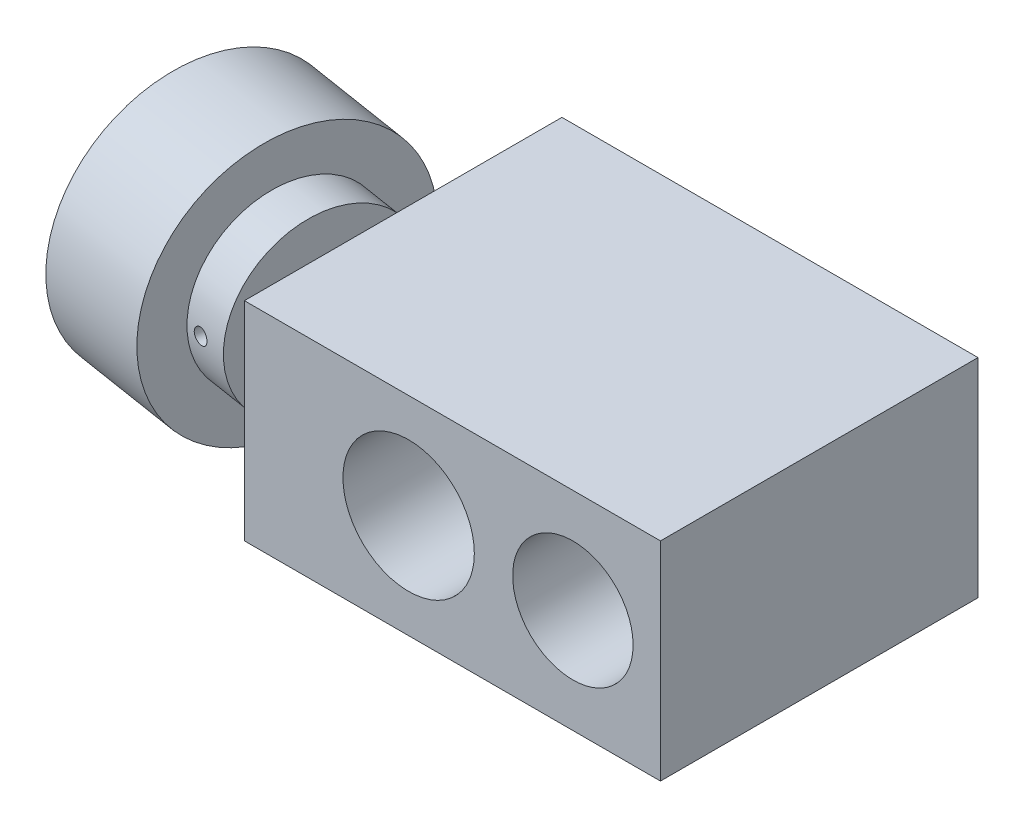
ISO-10303-21;
HEADER;
FILE_DESCRIPTION(('STEP AP214'),'2;1');
FILE_NAME('part.step','',(''),(''),'','','');
FILE_SCHEMA(('AUTOMOTIVE_DESIGN { 1 0 10303 214 1 1 1 1 }'));
ENDSEC;
DATA;
#1=APPLICATION_CONTEXT('core data for automotive mechanical design processes');
#2=APPLICATION_PROTOCOL_DEFINITION('international standard','automotive_design',2000,#1);
#3=PRODUCT_CONTEXT('',#1,'mechanical');
#4=PRODUCT('Part','Part','',(#3));
#5=PRODUCT_RELATED_PRODUCT_CATEGORY('part','',(#4));
#6=PRODUCT_DEFINITION_FORMATION('','',#4);
#7=PRODUCT_DEFINITION_CONTEXT('part definition',#1,'design');
#8=PRODUCT_DEFINITION('design','',#6,#7);
#9=PRODUCT_DEFINITION_SHAPE('','',#8);
#10=(LENGTH_UNIT() NAMED_UNIT(*) SI_UNIT(.MILLI.,.METRE.));
#11=(NAMED_UNIT(*) PLANE_ANGLE_UNIT() SI_UNIT($,.RADIAN.));
#12=(NAMED_UNIT(*) SI_UNIT($,.STERADIAN.) SOLID_ANGLE_UNIT());
#13=UNCERTAINTY_MEASURE_WITH_UNIT(LENGTH_MEASURE(1.E-05),#10,'distance_accuracy_value','');
#14=(GEOMETRIC_REPRESENTATION_CONTEXT(3) GLOBAL_UNCERTAINTY_ASSIGNED_CONTEXT((#13)) GLOBAL_UNIT_ASSIGNED_CONTEXT((#10,
#11,#12)) REPRESENTATION_CONTEXT('',''));
#15=CARTESIAN_POINT('',(0.,0.,0.));
#16=DIRECTION('',(0.,0.,1.));
#17=DIRECTION('',(1.,0.,0.));
#18=AXIS2_PLACEMENT_3D('',#15,#16,#17);
#19=CARTESIAN_POINT('',(-30.,-9.5,29.));
#20=DIRECTION('',(0.,1.,0.));
#21=DIRECTION('',(0.,0.,1.));
#22=AXIS2_PLACEMENT_3D('',#19,#20,#21);
#23=PLANE('',#22);
#24=DIRECTION('',(1.,0.,0.));
#25=VECTOR('',#24,1.);
#26=CARTESIAN_POINT('',(-30.,-9.5,0.));
#27=LINE('',#26,#25);
#28=CARTESIAN_POINT('',(-30.,-9.5,0.));
#29=VERTEX_POINT('',#28);
#30=CARTESIAN_POINT('',(8.,-9.5,0.));
#31=VERTEX_POINT('',#30);
#32=EDGE_CURVE('E538',#29,#31,#27,.T.);
#33=ORIENTED_EDGE('',*,*,#32,.T.);
#34=DIRECTION('',(0.,0.,-1.));
#35=VECTOR('',#34,1.);
#36=CARTESIAN_POINT('',(8.,-9.5,29.));
#37=LINE('',#36,#35);
#38=CARTESIAN_POINT('',(8.,-9.5,29.));
#39=VERTEX_POINT('',#38);
#40=EDGE_CURVE('E25',#39,#31,#37,.T.);
#41=ORIENTED_EDGE('',*,*,#40,.F.);
#42=DIRECTION('',(1.,0.,0.));
#43=VECTOR('',#42,1.);
#44=CARTESIAN_POINT('',(-30.,-9.5,29.));
#45=LINE('',#44,#43);
#46=CARTESIAN_POINT('',(-30.,-9.5,29.));
#47=VERTEX_POINT('',#46);
#48=EDGE_CURVE('E64',#47,#39,#45,.T.);
#49=ORIENTED_EDGE('',*,*,#48,.F.);
#50=DIRECTION('',(0.,0.,-1.));
#51=VECTOR('',#50,1.);
#52=CARTESIAN_POINT('',(-30.,-9.5,29.));
#53=LINE('',#52,#51);
#54=EDGE_CURVE('E10',#47,#29,#53,.T.);
#55=ORIENTED_EDGE('',*,*,#54,.T.);
#56=EDGE_LOOP('',(#33,#41,#49,#55));
#57=FACE_BOUND('',#56,.T.);
#58=CARTESIAN_POINT('',(-15.,-9.5,17.));
#59=DIRECTION('',(0.,1.,0.));
#60=DIRECTION('',(-1.,0.,0.));
#61=AXIS2_PLACEMENT_3D('',#58,#59,#60);
#62=CIRCLE('',#61,2.85);
#63=CARTESIAN_POINT('',(-17.85,-9.5,17.));
#64=VERTEX_POINT('',#63);
#65=EDGE_CURVE('E268',#64,#64,#62,.T.);
#66=ORIENTED_EDGE('',*,*,#65,.T.);
#67=EDGE_LOOP('',(#66));
#68=FACE_BOUND('',#67,.T.);
#69=ADVANCED_FACE('F16',(#57,#68),#23,.F.);
#70=CARTESIAN_POINT('',(-15.,0.,33.9418604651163));
#71=DIRECTION('',(0.,0.,1.));
#72=DIRECTION('',(1.,0.,0.));
#73=AXIS2_PLACEMENT_3D('',#70,#71,#72);
#74=CYLINDRICAL_SURFACE('',#73,6.);
#75=CARTESIAN_POINT('',(-15.,0.,6.));
#76=DIRECTION('',(0.,0.,1.));
#77=DIRECTION('',(1.,0.,0.));
#78=AXIS2_PLACEMENT_3D('',#75,#76,#77);
#79=CIRCLE('',#78,6.);
#80=CARTESIAN_POINT('',(-9.,0.,6.));
#81=VERTEX_POINT('',#80);
#82=EDGE_CURVE('E510',#81,#81,#79,.T.);
#83=ORIENTED_EDGE('',*,*,#82,.F.);
#84=EDGE_LOOP('',(#83));
#85=FACE_BOUND('',#84,.T.);
#86=CARTESIAN_POINT('',(-15.,0.,29.));
#87=DIRECTION('',(0.,0.,1.));
#88=DIRECTION('',(1.,0.,0.));
#89=AXIS2_PLACEMENT_3D('',#86,#87,#88);
#90=CIRCLE('',#89,6.);
#91=CARTESIAN_POINT('',(-9.,0.,29.));
#92=VERTEX_POINT('',#91);
#93=EDGE_CURVE('E513',#92,#92,#90,.T.);
#94=ORIENTED_EDGE('',*,*,#93,.T.);
#95=EDGE_LOOP('',(#94));
#96=FACE_BOUND('',#95,.T.);
#97=ADVANCED_FACE('F424',(#85,#96),#74,.F.);
#98=CARTESIAN_POINT('',(-30.,-9.5,29.));
#99=DIRECTION('',(0.,0.,1.));
#100=DIRECTION('',(1.,0.,0.));
#101=AXIS2_PLACEMENT_3D('',#98,#99,#100);
#102=PLANE('',#101);
#103=CARTESIAN_POINT('',(0.,0.,29.));
#104=DIRECTION('',(0.,0.,1.));
#105=DIRECTION('',(1.,0.,0.));
#106=AXIS2_PLACEMENT_3D('',#103,#104,#105);
#107=CIRCLE('',#106,5.5);
#108=CARTESIAN_POINT('',(5.5,0.,29.));
#109=VERTEX_POINT('',#108);
#110=EDGE_CURVE('E525',#109,#109,#107,.T.);
#111=ORIENTED_EDGE('',*,*,#110,.F.);
#112=EDGE_LOOP('',(#111));
#113=FACE_BOUND('',#112,.T.);
#114=DIRECTION('',(0.,-1.,0.));
#115=VECTOR('',#114,1.);
#116=CARTESIAN_POINT('',(-30.,9.5,29.));
#117=LINE('',#116,#115);
#118=CARTESIAN_POINT('',(-30.,9.5,29.));
#119=VERTEX_POINT('',#118);
#120=EDGE_CURVE('E529',#119,#47,#117,.T.);
#121=ORIENTED_EDGE('',*,*,#120,.T.);
#122=ORIENTED_EDGE('',*,*,#48,.T.);
#123=DIRECTION('',(0.,1.,0.));
#124=VECTOR('',#123,1.);
#125=CARTESIAN_POINT('',(8.,9.5,29.));
#126=LINE('',#125,#124);
#127=CARTESIAN_POINT('',(8.,9.5,29.));
#128=VERTEX_POINT('',#127);
#129=EDGE_CURVE('E532',#39,#128,#126,.T.);
#130=ORIENTED_EDGE('',*,*,#129,.T.);
#131=DIRECTION('',(-1.,0.,0.));
#132=VECTOR('',#131,1.);
#133=CARTESIAN_POINT('',(-30.,9.5,29.));
#134=LINE('',#133,#132);
#135=EDGE_CURVE('E33',#128,#119,#134,.T.);
#136=ORIENTED_EDGE('',*,*,#135,.T.);
#137=EDGE_LOOP('',(#121,#122,#130,#136));
#138=FACE_BOUND('',#137,.T.);
#139=ORIENTED_EDGE('',*,*,#93,.F.);
#140=EDGE_LOOP('',(#139));
#141=FACE_BOUND('',#140,.T.);
#142=ADVANCED_FACE('F429',(#113,#138,#141),#102,.T.);
#143=CARTESIAN_POINT('',(-30.,-9.5,0.));
#144=DIRECTION('',(0.,0.,1.));
#145=DIRECTION('',(1.,0.,0.));
#146=AXIS2_PLACEMENT_3D('',#143,#144,#145);
#147=PLANE('',#146);
#148=DIRECTION('',(0.,-1.,0.));
#149=VECTOR('',#148,1.);
#150=CARTESIAN_POINT('',(-30.,9.5,0.));
#151=LINE('',#150,#149);
#152=CARTESIAN_POINT('',(-30.,9.5,0.));
#153=VERTEX_POINT('',#152);
#154=EDGE_CURVE('E528',#153,#29,#151,.T.);
#155=ORIENTED_EDGE('',*,*,#154,.F.);
#156=DIRECTION('',(-1.,0.,0.));
#157=VECTOR('',#156,1.);
#158=CARTESIAN_POINT('',(-30.,9.5,0.));
#159=LINE('',#158,#157);
#160=CARTESIAN_POINT('',(8.,9.5,0.));
#161=VERTEX_POINT('',#160);
#162=EDGE_CURVE('E57',#161,#153,#159,.T.);
#163=ORIENTED_EDGE('',*,*,#162,.F.);
#164=DIRECTION('',(0.,1.,0.));
#165=VECTOR('',#164,1.);
#166=CARTESIAN_POINT('',(8.,9.5,0.));
#167=LINE('',#166,#165);
#168=EDGE_CURVE('E51',#31,#161,#167,.T.);
#169=ORIENTED_EDGE('',*,*,#168,.F.);
#170=ORIENTED_EDGE('',*,*,#32,.F.);
#171=EDGE_LOOP('',(#155,#163,#169,#170));
#172=FACE_BOUND('',#171,.T.);
#173=CARTESIAN_POINT('',(0.,0.,0.));
#174=DIRECTION('',(0.,0.,1.));
#175=DIRECTION('',(1.,0.,0.));
#176=AXIS2_PLACEMENT_3D('',#173,#174,#175);
#177=CIRCLE('',#176,3.3);
#178=CARTESIAN_POINT('',(3.3,0.,0.));
#179=VERTEX_POINT('',#178);
#180=EDGE_CURVE('E516',#179,#179,#177,.T.);
#181=ORIENTED_EDGE('',*,*,#180,.T.);
#182=EDGE_LOOP('',(#181));
#183=FACE_BOUND('',#182,.T.);
#184=ADVANCED_FACE('F441',(#172,#183),#147,.F.);
#185=CARTESIAN_POINT('',(-30.,9.5,29.));
#186=DIRECTION('',(1.,0.,0.));
#187=DIRECTION('',(0.,0.,-1.));
#188=AXIS2_PLACEMENT_3D('',#185,#186,#187);
#189=PLANE('',#188);
#190=CARTESIAN_POINT('',(-30.,0.,17.6));
#191=DIRECTION('',(1.,0.,0.));
#192=DIRECTION('',(0.,0.,-1.));
#193=AXIS2_PLACEMENT_3D('',#190,#191,#192);
#194=ELLIPSE('',#193,3.037395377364,3.);
#195=CARTESIAN_POINT('',(-30.,0.,14.562604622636));
#196=VERTEX_POINT('',#195);
#197=EDGE_CURVE('E507',#196,#196,#194,.T.);
#198=ORIENTED_EDGE('',*,*,#197,.T.);
#199=EDGE_LOOP('',(#198));
#200=FACE_BOUND('',#199,.T.);
#201=ORIENTED_EDGE('',*,*,#154,.T.);
#202=ORIENTED_EDGE('',*,*,#54,.F.);
#203=ORIENTED_EDGE('',*,*,#120,.F.);
#204=DIRECTION('',(0.,0.,-1.));
#205=VECTOR('',#204,1.);
#206=CARTESIAN_POINT('',(-30.,9.5,29.));
#207=LINE('',#206,#205);
#208=EDGE_CURVE('E535',#119,#153,#207,.T.);
#209=ORIENTED_EDGE('',*,*,#208,.T.);
#210=EDGE_LOOP('',(#201,#202,#203,#209));
#211=FACE_BOUND('',#210,.T.);
#212=ADVANCED_FACE('F18',(#200,#211),#189,.F.);
#213=CARTESIAN_POINT('',(8.,9.5,29.));
#214=DIRECTION('',(-1.,0.,0.));
#215=DIRECTION('',(0.,-1.,0.));
#216=AXIS2_PLACEMENT_3D('',#213,#214,#215);
#217=PLANE('',#216);
#218=ORIENTED_EDGE('',*,*,#168,.T.);
#219=DIRECTION('',(0.,0.,-1.));
#220=VECTOR('',#219,1.);
#221=CARTESIAN_POINT('',(8.,9.5,29.));
#222=LINE('',#221,#220);
#223=EDGE_CURVE('E543',#128,#161,#222,.T.);
#224=ORIENTED_EDGE('',*,*,#223,.F.);
#225=ORIENTED_EDGE('',*,*,#129,.F.);
#226=ORIENTED_EDGE('',*,*,#40,.T.);
#227=EDGE_LOOP('',(#218,#224,#225,#226));
#228=FACE_BOUND('',#227,.T.);
#229=ADVANCED_FACE('F434',(#228),#217,.F.);
#230=CARTESIAN_POINT('',(-30.,9.5,29.));
#231=DIRECTION('',(0.,-1.,0.));
#232=DIRECTION('',(0.,0.,-1.));
#233=AXIS2_PLACEMENT_3D('',#230,#231,#232);
#234=PLANE('',#233);
#235=ORIENTED_EDGE('',*,*,#162,.T.);
#236=ORIENTED_EDGE('',*,*,#208,.F.);
#237=ORIENTED_EDGE('',*,*,#135,.F.);
#238=ORIENTED_EDGE('',*,*,#223,.T.);
#239=EDGE_LOOP('',(#235,#236,#237,#238));
#240=FACE_BOUND('',#239,.T.);
#241=ADVANCED_FACE('F437',(#240),#234,.F.);
#242=CARTESIAN_POINT('',(0.,0.,33.0328903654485));
#243=DIRECTION('',(0.,0.,1.));
#244=DIRECTION('',(1.,0.,0.));
#245=AXIS2_PLACEMENT_3D('',#242,#243,#244);
#246=CYLINDRICAL_SURFACE('',#245,5.5);
#247=ORIENTED_EDGE('',*,*,#110,.T.);
#248=EDGE_LOOP('',(#247));
#249=FACE_BOUND('',#248,.T.);
#250=CARTESIAN_POINT('',(0.,0.,15.));
#251=DIRECTION('',(0.,0.,1.));
#252=DIRECTION('',(1.,0.,0.));
#253=AXIS2_PLACEMENT_3D('',#250,#251,#252);
#254=CIRCLE('',#253,5.5);
#255=CARTESIAN_POINT('',(5.5,0.,15.));
#256=VERTEX_POINT('',#255);
#257=EDGE_CURVE('E522',#256,#256,#254,.T.);
#258=ORIENTED_EDGE('',*,*,#257,.F.);
#259=EDGE_LOOP('',(#258));
#260=FACE_BOUND('',#259,.T.);
#261=ADVANCED_FACE('F440',(#249,#260),#246,.F.);
#262=CARTESIAN_POINT('',(-5.5,0.,15.));
#263=DIRECTION('',(0.,0.,1.));
#264=DIRECTION('',(1.,0.,0.));
#265=AXIS2_PLACEMENT_3D('',#262,#263,#264);
#266=PLANE('',#265);
#267=ORIENTED_EDGE('',*,*,#257,.T.);
#268=EDGE_LOOP('',(#267));
#269=FACE_BOUND('',#268,.T.);
#270=CARTESIAN_POINT('',(0.,0.,15.));
#271=DIRECTION('',(0.,0.,1.));
#272=DIRECTION('',(1.,0.,0.));
#273=AXIS2_PLACEMENT_3D('',#270,#271,#272);
#274=CIRCLE('',#273,3.3);
#275=CARTESIAN_POINT('',(3.3,0.,15.));
#276=VERTEX_POINT('',#275);
#277=EDGE_CURVE('E519',#276,#276,#274,.T.);
#278=ORIENTED_EDGE('',*,*,#277,.F.);
#279=EDGE_LOOP('',(#278));
#280=FACE_BOUND('',#279,.T.);
#281=ADVANCED_FACE('F450',(#269,#280),#266,.T.);
#282=CARTESIAN_POINT('',(0.,0.,33.0328903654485));
#283=DIRECTION('',(0.,0.,1.));
#284=DIRECTION('',(1.,0.,0.));
#285=AXIS2_PLACEMENT_3D('',#282,#283,#284);
#286=CYLINDRICAL_SURFACE('',#285,3.3);
#287=ORIENTED_EDGE('',*,*,#277,.T.);
#288=EDGE_LOOP('',(#287));
#289=FACE_BOUND('',#288,.T.);
#290=ORIENTED_EDGE('',*,*,#180,.F.);
#291=EDGE_LOOP('',(#290));
#292=FACE_BOUND('',#291,.T.);
#293=ADVANCED_FACE('F454',(#289,#292),#286,.F.);
#294=CARTESIAN_POINT('',(-21.,0.,6.));
#295=DIRECTION('',(0.,0.,1.));
#296=DIRECTION('',(1.,0.,0.));
#297=AXIS2_PLACEMENT_3D('',#294,#295,#296);
#298=PLANE('',#297);
#299=ORIENTED_EDGE('',*,*,#82,.T.);
#300=EDGE_LOOP('',(#299));
#301=FACE_BOUND('',#300,.T.);
#302=ADVANCED_FACE('F421',(#301),#298,.T.);
#303=CARTESIAN_POINT('',(-20.3356408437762,0.,19.1306841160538));
#304=DIRECTION('',(0.987688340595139,0.,0.156434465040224));
#305=DIRECTION('',(0.,-1.,0.));
#306=AXIS2_PLACEMENT_3D('',#303,#304,#305);
#307=CYLINDRICAL_SURFACE('',#306,3.);
#308=ORIENTED_EDGE('',*,*,#197,.F.);
#309=EDGE_LOOP('',(#308));
#310=FACE_BOUND('',#309,.T.);
#311=CARTESIAN_POINT('',(-34.9534282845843,0.,16.8154540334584));
#312=DIRECTION('',(-0.987688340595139,0.,-0.156434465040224));
#313=DIRECTION('',(-0.156434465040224,0.,0.987688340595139));
#314=AXIS2_PLACEMENT_3D('',#311,#312,#313);
#315=CIRCLE('',#314,3.);
#316=CARTESIAN_POINT('',(-35.422731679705,0.,19.7785190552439));
#317=VERTEX_POINT('',#316);
#318=EDGE_CURVE('E504',#317,#317,#315,.T.);
#319=ORIENTED_EDGE('',*,*,#318,.F.);
#320=EDGE_LOOP('',(#319));
#321=FACE_BOUND('',#320,.T.);
#322=ADVANCED_FACE('F409',(#310,#321),#307,.T.);
#323=CARTESIAN_POINT('',(-54.7071950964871,0.,13.6867647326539));
#324=DIRECTION('',(-0.987688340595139,0.,-0.156434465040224));
#325=DIRECTION('',(0.,-1.,0.));
#326=AXIS2_PLACEMENT_3D('',#323,#324,#325);
#327=CYLINDRICAL_SURFACE('',#326,8.);
#328=CARTESIAN_POINT('',(-34.9534282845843,0.,16.8154540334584));
#329=DIRECTION('',(-0.987688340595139,0.,-0.156434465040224));
#330=DIRECTION('',(0.,-1.,0.));
#331=AXIS2_PLACEMENT_3D('',#328,#329,#330);
#332=CIRCLE('',#331,8.);
#333=CARTESIAN_POINT('',(-34.9534282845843,-8.,16.8154540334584));
#334=VERTEX_POINT('',#333);
#335=EDGE_CURVE('E329',#334,#334,#332,.T.);
#336=ORIENTED_EDGE('',*,*,#335,.T.);
#337=EDGE_LOOP('',(#336));
#338=FACE_BOUND('',#337,.T.);
#339=CARTESIAN_POINT('',(-38.9041816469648,0.,16.1897161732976));
#340=DIRECTION('',(-0.987688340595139,0.,-0.156434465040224));
#341=DIRECTION('',(0.,-1.,0.));
#342=AXIS2_PLACEMENT_3D('',#339,#340,#341);
#343=CIRCLE('',#342,8.);
#344=CARTESIAN_POINT('',(-38.9041816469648,-8.,16.1897161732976));
#345=VERTEX_POINT('',#344);
#346=EDGE_CURVE('E1208',#345,#345,#343,.T.);
#347=ORIENTED_EDGE('',*,*,#346,.F.);
#348=EDGE_LOOP('',(#347));
#349=FACE_BOUND('',#348,.T.);
#350=CARTESIAN_POINT('',(-37.9827430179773,0.,24.4353787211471));
#351=CARTESIAN_POINT('',(-37.9827446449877,0.0392387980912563,24.435378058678));
#352=CARTESIAN_POINT('',(-37.9859670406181,0.0785041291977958,24.4345726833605));
#353=CARTESIAN_POINT('',(-37.9987777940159,0.155947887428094,24.4313952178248));
#354=CARTESIAN_POINT('',(-38.0083733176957,0.194125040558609,24.4290213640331));
#355=CARTESIAN_POINT('',(-38.0336613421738,0.268259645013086,24.4228460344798));
#356=CARTESIAN_POINT('',(-38.0493503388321,0.304218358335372,24.4190453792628));
#357=CARTESIAN_POINT('',(-38.0863904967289,0.372916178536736,24.4102327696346));
#358=CARTESIAN_POINT('',(-38.1077404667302,0.405655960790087,24.4052210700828));
#359=CARTESIAN_POINT('',(-38.1555819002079,0.467086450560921,24.3942466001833));
#360=CARTESIAN_POINT('',(-38.1820859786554,0.495766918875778,24.3882815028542));
#361=CARTESIAN_POINT('',(-38.239479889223,0.548176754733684,24.3757218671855));
#362=CARTESIAN_POINT('',(-38.2703699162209,0.57190590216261,24.3691273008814));
#363=CARTESIAN_POINT('',(-38.3357424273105,0.613774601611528,24.3556235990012));
#364=CARTESIAN_POINT('',(-38.3702306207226,0.631905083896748,24.3487139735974));
#365=CARTESIAN_POINT('',(-38.4418007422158,0.662003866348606,24.3349060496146));
#366=CARTESIAN_POINT('',(-38.478882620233,0.673972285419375,24.3280077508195));
#367=CARTESIAN_POINT('',(-38.5544995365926,0.691377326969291,24.3145220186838));
#368=CARTESIAN_POINT('',(-38.5930305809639,0.696830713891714,24.3079338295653));
#369=CARTESIAN_POINT('',(-38.6705428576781,0.701102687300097,24.2952777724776));
#370=CARTESIAN_POINT('',(-38.7095240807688,0.699921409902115,24.2892098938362));
#371=CARTESIAN_POINT('',(-38.7867149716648,0.690971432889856,24.2777747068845));
#372=CARTESIAN_POINT('',(-38.8249264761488,0.683220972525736,24.2724055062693));
#373=CARTESIAN_POINT('',(-38.899598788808,0.661380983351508,24.2624433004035));
#374=CARTESIAN_POINT('',(-38.9360595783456,0.647291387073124,24.2578503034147));
#375=CARTESIAN_POINT('',(-39.0062376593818,0.613152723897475,24.2494664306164));
#376=CARTESIAN_POINT('',(-39.0399511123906,0.593095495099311,24.2456766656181));
#377=CARTESIAN_POINT('',(-39.1036144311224,0.54759679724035,24.238885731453));
#378=CARTESIAN_POINT('',(-39.1335642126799,0.522155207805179,24.23588457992));
#379=CARTESIAN_POINT('',(-39.188933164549,0.466507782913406,24.2306031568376));
#380=CARTESIAN_POINT('',(-39.214336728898,0.436286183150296,24.228325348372));
#381=CARTESIAN_POINT('',(-39.2597478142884,0.371991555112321,24.2244254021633));
#382=CARTESIAN_POINT('',(-39.2797553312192,0.337918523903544,24.2228032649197));
#383=CARTESIAN_POINT('',(-39.3137854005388,0.266877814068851,24.2201340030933));
#384=CARTESIAN_POINT('',(-39.3278072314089,0.229909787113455,24.2190869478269));
#385=CARTESIAN_POINT('',(-39.3494414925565,0.154133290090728,24.2175023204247));
#386=CARTESIAN_POINT('',(-39.3570540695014,0.115324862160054,24.2169647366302));
#387=CARTESIAN_POINT('',(-39.3656251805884,0.0371061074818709,24.2163610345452));
#388=CARTESIAN_POINT('',(-39.3666055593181,-0.00230181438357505,24.2162933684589));
#389=CARTESIAN_POINT('',(-39.3619405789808,-0.0807211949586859,24.2166202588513));
#390=CARTESIAN_POINT('',(-39.3562952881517,-0.119732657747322,24.2170148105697));
#391=CARTESIAN_POINT('',(-39.3385637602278,-0.196189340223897,24.2182942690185));
#392=CARTESIAN_POINT('',(-39.3264876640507,-0.233636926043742,24.2191784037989));
#393=CARTESIAN_POINT('',(-39.2962608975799,-0.305976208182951,24.2214945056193));
#394=CARTESIAN_POINT('',(-39.2781101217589,-0.340867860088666,24.2229264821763));
#395=CARTESIAN_POINT('',(-39.2362131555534,-0.407203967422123,24.2264192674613));
#396=CARTESIAN_POINT('',(-39.2124526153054,-0.438639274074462,24.2284816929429));
#397=CARTESIAN_POINT('',(-39.1600535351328,-0.497077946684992,24.2333149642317));
#398=CARTESIAN_POINT('',(-39.1314149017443,-0.524081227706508,24.2360858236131));
#399=CARTESIAN_POINT('',(-39.0700010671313,-0.57296437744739,24.2424117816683));
#400=CARTESIAN_POINT('',(-39.0372147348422,-0.594829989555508,24.2459690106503));
#401=CARTESIAN_POINT('',(-38.9685140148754,-0.632719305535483,24.2538984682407));
#402=CARTESIAN_POINT('',(-38.9325996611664,-0.648743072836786,24.2582706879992));
#403=CARTESIAN_POINT('',(-38.8587294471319,-0.674469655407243,24.2678091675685));
#404=CARTESIAN_POINT('',(-38.8207764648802,-0.684181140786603,24.2729743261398));
#405=CARTESIAN_POINT('',(-38.7438764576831,-0.697035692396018,24.2840264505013));
#406=CARTESIAN_POINT('',(-38.7049294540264,-0.700178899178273,24.2899134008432));
#407=CARTESIAN_POINT('',(-38.6272906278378,-0.699805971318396,24.3022433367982));
#408=CARTESIAN_POINT('',(-38.5885983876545,-0.696312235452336,24.3086843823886));
#409=CARTESIAN_POINT('',(-38.5124320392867,-0.682811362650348,24.3219304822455));
#410=CARTESIAN_POINT('',(-38.4749579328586,-0.672804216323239,24.3287355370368));
#411=CARTESIAN_POINT('',(-38.4022791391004,-0.646566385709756,24.3424446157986));
#412=CARTESIAN_POINT('',(-38.367074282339,-0.630336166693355,24.3493486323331));
#413=CARTESIAN_POINT('',(-38.2999023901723,-0.592115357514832,24.3629526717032));
#414=CARTESIAN_POINT('',(-38.2679353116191,-0.570124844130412,24.3696526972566));
#415=CARTESIAN_POINT('',(-38.20801281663,-0.5209234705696,24.3825483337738));
#416=CARTESIAN_POINT('',(-38.1800706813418,-0.493695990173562,24.3887422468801));
#417=CARTESIAN_POINT('',(-38.1290775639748,-0.434824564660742,24.4002834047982));
#418=CARTESIAN_POINT('',(-38.1060277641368,-0.403179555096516,24.4056304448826));
#419=CARTESIAN_POINT('',(-38.0654173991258,-0.33630437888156,24.4151953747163));
#420=CARTESIAN_POINT('',(-38.0478679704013,-0.301067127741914,24.4194109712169));
#421=CARTESIAN_POINT('',(-38.018822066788,-0.228082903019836,24.4264558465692));
#422=CARTESIAN_POINT('',(-38.0073186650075,-0.190338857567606,24.4292867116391));
#423=CARTESIAN_POINT('',(-37.9935933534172,-0.126978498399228,24.4326793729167));
#424=CARTESIAN_POINT('',(-37.9895297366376,-0.101769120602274,24.4336891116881));
#425=CARTESIAN_POINT('',(-37.9841040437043,-0.0510435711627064,24.4350390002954));
#426=CARTESIAN_POINT('',(-37.9827419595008,-0.0255274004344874,24.4353791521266));
#427=CARTESIAN_POINT('',(-37.9827430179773,0.,24.4353787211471));
#428=B_SPLINE_CURVE_WITH_KNOTS('',3,(#350,#351,#352,#353,#354,#355,#356,#357,#358,#359,#360,
#361,#362,#363,#364,#365,#366,#367,#368,#369,#370,#371,#372,#373,#374,#375,#376,#377,#378,#379,
#380,#381,#382,#383,#384,#385,#386,#387,#388,#389,#390,#391,#392,#393,#394,#395,#396,#397,#398,
#399,#400,#401,#402,#403,#404,#405,#406,#407,#408,#409,#410,#411,#412,#413,#414,#415,#416,#417,
#418,#419,#420,#421,#422,#423,#424,#425,#426,#427),.UNSPECIFIED.,.T.,.F.,(4,2,2,2,2,2,2,2,2,2,2,
2,2,2,2,2,2,2,2,2,2,2,2,2,2,2,2,2,2,2,2,2,2,2,2,2,2,2,4),(0.,0.11762318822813,0.235378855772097,
0.353066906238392,0.47073021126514,0.58868521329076,0.706645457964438,0.824795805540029,
0.942943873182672,1.0607872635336,1.17862823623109,1.29614309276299,1.41365920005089,
1.53133677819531,1.64901698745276,1.7670937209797,1.88517054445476,2.00326159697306,
2.12134994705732,2.23904915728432,2.35674715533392,2.47426009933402,2.59177508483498,
2.70959399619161,2.82741516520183,2.94555951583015,3.06370258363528,3.18168303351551,
3.29966095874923,3.41724143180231,3.53482207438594,3.65239392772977,3.76996421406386,
3.88791397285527,4.0058922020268,4.12410777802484,4.24218761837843,4.31870941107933,
4.39523097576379),.UNSPECIFIED.);
#429=CARTESIAN_POINT('',(-37.9827430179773,0.,24.4353787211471));
#430=VERTEX_POINT('',#429);
#431=EDGE_CURVE('E295',#430,#430,#428,.T.);
#432=ORIENTED_EDGE('',*,*,#431,.F.);
#433=EDGE_LOOP('',(#432));
#434=FACE_BOUND('',#433,.T.);
#435=ADVANCED_FACE('F305',(#338,#349,#434),#327,.T.);
#436=CARTESIAN_POINT('',(-34.9534282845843,3.,16.8154540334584));
#437=DIRECTION('',(-0.987688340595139,0.,-0.156434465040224));
#438=DIRECTION('',(0.,-1.,0.));
#439=AXIS2_PLACEMENT_3D('',#436,#437,#438);
#440=PLANE('',#439);
#441=ORIENTED_EDGE('',*,*,#335,.F.);
#442=EDGE_LOOP('',(#441));
#443=FACE_BOUND('',#442,.T.);
#444=ORIENTED_EDGE('',*,*,#318,.T.);
#445=EDGE_LOOP('',(#444));
#446=FACE_BOUND('',#445,.T.);
#447=ADVANCED_FACE('F562',(#443,#446),#440,.F.);
#448=CARTESIAN_POINT('',(-38.9041816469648,8.,16.1897161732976));
#449=DIRECTION('',(-0.987688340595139,0.,-0.156434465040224));
#450=DIRECTION('',(0.,-1.,0.));
#451=AXIS2_PLACEMENT_3D('',#448,#449,#450);
#452=PLANE('',#451);
#453=CARTESIAN_POINT('',(-38.9041816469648,0.,16.1897161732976));
#454=DIRECTION('',(-0.987688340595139,0.,-0.156434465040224));
#455=DIRECTION('',(0.,-1.,0.));
#456=AXIS2_PLACEMENT_3D('',#453,#454,#455);
#457=CIRCLE('',#456,12.);
#458=CARTESIAN_POINT('',(-38.9041816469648,-12.,16.1897161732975));
#459=VERTEX_POINT('',#458);
#460=EDGE_CURVE('E1202',#459,#459,#457,.T.);
#461=ORIENTED_EDGE('',*,*,#460,.F.);
#462=EDGE_LOOP('',(#461));
#463=FACE_BOUND('',#462,.T.);
#464=ORIENTED_EDGE('',*,*,#346,.T.);
#465=EDGE_LOOP('',(#464));
#466=FACE_BOUND('',#465,.T.);
#467=ADVANCED_FACE('F564',(#463,#466),#452,.F.);
#468=CARTESIAN_POINT('',(-54.7071950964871,0.,13.6867647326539));
#469=DIRECTION('',(-0.987688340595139,0.,-0.156434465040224));
#470=DIRECTION('',(0.,-1.,0.));
#471=AXIS2_PLACEMENT_3D('',#468,#469,#470);
#472=CYLINDRICAL_SURFACE('',#471,12.);
#473=ORIENTED_EDGE('',*,*,#460,.T.);
#474=EDGE_LOOP('',(#473));
#475=FACE_BOUND('',#474,.T.);
#476=CARTESIAN_POINT('',(-48.7810650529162,0.,14.6253715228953));
#477=DIRECTION('',(-0.987688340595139,0.,-0.156434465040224));
#478=DIRECTION('',(0.,-1.,0.));
#479=AXIS2_PLACEMENT_3D('',#476,#477,#478);
#480=CIRCLE('',#479,12.);
#481=CARTESIAN_POINT('',(-48.7810650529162,-12.,14.6253715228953));
#482=VERTEX_POINT('',#481);
#483=EDGE_CURVE('E1205',#482,#482,#480,.T.);
#484=ORIENTED_EDGE('',*,*,#483,.F.);
#485=EDGE_LOOP('',(#484));
#486=FACE_BOUND('',#485,.T.);
#487=ADVANCED_FACE('F571',(#475,#486),#472,.T.);
#488=CARTESIAN_POINT('',(-48.7810650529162,9.,14.6253715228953));
#489=DIRECTION('',(-0.987688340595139,0.,-0.156434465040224));
#490=DIRECTION('',(0.,-1.,0.));
#491=AXIS2_PLACEMENT_3D('',#488,#489,#490);
#492=PLANE('',#491);
#493=ORIENTED_EDGE('',*,*,#483,.T.);
#494=EDGE_LOOP('',(#493));
#495=FACE_BOUND('',#494,.T.);
#496=CARTESIAN_POINT('',(-48.7810650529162,0.,14.6253715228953));
#497=DIRECTION('',(-0.987688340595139,0.,-0.156434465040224));
#498=DIRECTION('',(0.,-1.,0.));
#499=AXIS2_PLACEMENT_3D('',#496,#497,#498);
#500=CIRCLE('',#499,9.);
#501=CARTESIAN_POINT('',(-48.7810650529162,-9.,14.6253715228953));
#502=VERTEX_POINT('',#501);
#503=EDGE_CURVE('E1206',#502,#502,#500,.T.);
#504=ORIENTED_EDGE('',*,*,#503,.F.);
#505=EDGE_LOOP('',(#504));
#506=FACE_BOUND('',#505,.T.);
#507=ADVANCED_FACE('F809',(#495,#506),#492,.T.);
#508=CARTESIAN_POINT('',(-54.7071950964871,0.,13.6867647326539));
#509=DIRECTION('',(-0.987688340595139,0.,-0.156434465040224));
#510=DIRECTION('',(0.,-1.,0.));
#511=AXIS2_PLACEMENT_3D('',#508,#509,#510);
#512=CYLINDRICAL_SURFACE('',#511,9.);
#513=ORIENTED_EDGE('',*,*,#503,.T.);
#514=EDGE_LOOP('',(#513));
#515=FACE_BOUND('',#514,.T.);
#516=CARTESIAN_POINT('',(-42.8549350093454,0.,15.5639783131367));
#517=DIRECTION('',(-0.987688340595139,0.,-0.156434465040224));
#518=DIRECTION('',(0.,-1.,0.));
#519=AXIS2_PLACEMENT_3D('',#516,#517,#518);
#520=CIRCLE('',#519,9.);
#521=CARTESIAN_POINT('',(-42.8549350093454,-9.,15.5639783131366));
#522=VERTEX_POINT('',#521);
#523=EDGE_CURVE('E1211',#522,#522,#520,.T.);
#524=ORIENTED_EDGE('',*,*,#523,.F.);
#525=EDGE_LOOP('',(#524));
#526=FACE_BOUND('',#525,.T.);
#527=ADVANCED_FACE('F802',(#515,#526),#512,.F.);
#528=CARTESIAN_POINT('',(-42.8549350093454,3.,15.5639783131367));
#529=DIRECTION('',(-0.987688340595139,0.,-0.156434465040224));
#530=DIRECTION('',(0.,-1.,0.));
#531=AXIS2_PLACEMENT_3D('',#528,#529,#530);
#532=PLANE('',#531);
#533=ORIENTED_EDGE('',*,*,#523,.T.);
#534=EDGE_LOOP('',(#533));
#535=FACE_BOUND('',#534,.T.);
#536=CARTESIAN_POINT('',(-42.8549350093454,0.,15.5639783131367));
#537=DIRECTION('',(-0.987688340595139,0.,-0.156434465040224));
#538=DIRECTION('',(0.,-1.,0.));
#539=AXIS2_PLACEMENT_3D('',#536,#537,#538);
#540=CIRCLE('',#539,3.);
#541=CARTESIAN_POINT('',(-42.8549350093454,-3.,15.5639783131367));
#542=VERTEX_POINT('',#541);
#543=EDGE_CURVE('E303',#542,#542,#540,.T.);
#544=ORIENTED_EDGE('',*,*,#543,.F.);
#545=EDGE_LOOP('',(#544));
#546=FACE_BOUND('',#545,.T.);
#547=ADVANCED_FACE('F315',(#535,#546),#532,.T.);
#548=CARTESIAN_POINT('',(-38.9869937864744,0.,26.3012512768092));
#549=DIRECTION('',(0.156434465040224,0.,-0.987688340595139));
#550=DIRECTION('',(0.987688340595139,0.,0.156434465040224));
#551=AXIS2_PLACEMENT_3D('',#548,#549,#550);
#552=CYLINDRICAL_SURFACE('',#551,0.7);
#553=CARTESIAN_POINT('',(-37.2005706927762,0.,19.4969370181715));
#554=CARTESIAN_POINT('',(-37.2005717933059,0.0387568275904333,19.4969361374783));
#555=CARTESIAN_POINT('',(-37.2036418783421,0.0775279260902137,19.4956825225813));
#556=CARTESIAN_POINT('',(-37.215834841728,0.153964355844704,19.490764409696));
#557=CARTESIAN_POINT('',(-37.2249616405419,0.191628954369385,19.4870983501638));
#558=CARTESIAN_POINT('',(-37.2489898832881,0.264737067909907,19.4776460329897));
#559=CARTESIAN_POINT('',(-37.263884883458,0.300183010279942,19.4718621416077));
#560=CARTESIAN_POINT('',(-37.2990462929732,0.367951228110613,19.4586054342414));
#561=CARTESIAN_POINT('',(-37.3193127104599,0.400273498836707,19.4511326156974));
#562=CARTESIAN_POINT('',(-37.3650822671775,0.461462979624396,19.4348981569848));
#563=CARTESIAN_POINT('',(-37.3906651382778,0.490265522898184,19.4261175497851));
#564=CARTESIAN_POINT('',(-37.4462366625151,0.543036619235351,19.4079755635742));
#565=CARTESIAN_POINT('',(-37.4762257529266,0.567004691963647,19.3986141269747));
#566=CARTESIAN_POINT('',(-37.5402920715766,0.609720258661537,19.3798198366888));
#567=CARTESIAN_POINT('',(-37.5744165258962,0.628397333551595,19.3703875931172));
#568=CARTESIAN_POINT('',(-37.6455530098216,0.659548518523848,19.3521895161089));
#569=CARTESIAN_POINT('',(-37.6825646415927,0.672023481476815,19.3434235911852));
#570=CARTESIAN_POINT('',(-37.7577756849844,0.690199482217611,19.3272209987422));
#571=CARTESIAN_POINT('',(-37.7959427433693,0.696015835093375,19.3197636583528));
#572=CARTESIAN_POINT('',(-37.8729658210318,0.701068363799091,19.3063397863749));
#573=CARTESIAN_POINT('',(-37.9118217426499,0.700305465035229,19.3003730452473));
#574=CARTESIAN_POINT('',(-37.9882551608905,0.69231358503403,19.2901975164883));
#575=CARTESIAN_POINT('',(-38.0258424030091,0.685220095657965,19.2859545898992));
#576=CARTESIAN_POINT('',(-38.0994992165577,0.664983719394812,19.2790201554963));
#577=CARTESIAN_POINT('',(-38.1355686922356,0.651840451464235,19.2763287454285));
#578=CARTESIAN_POINT('',(-38.2054998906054,0.619757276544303,19.2722973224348));
#579=CARTESIAN_POINT('',(-38.2393389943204,0.600766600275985,19.2709696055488));
#580=CARTESIAN_POINT('',(-38.3035309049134,0.557563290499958,19.2694086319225));
#581=CARTESIAN_POINT('',(-38.3338831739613,0.533349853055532,19.2691755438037));
#582=CARTESIAN_POINT('',(-38.3909705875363,0.479678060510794,19.269447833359));
#583=CARTESIAN_POINT('',(-38.4175978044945,0.450104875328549,19.2699716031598));
#584=CARTESIAN_POINT('',(-38.4655324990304,0.386926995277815,19.2713905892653));
#585=CARTESIAN_POINT('',(-38.4868398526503,0.353322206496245,19.2722858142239));
#586=CARTESIAN_POINT('',(-38.5235095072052,0.282891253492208,19.2740826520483));
#587=CARTESIAN_POINT('',(-38.5388557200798,0.246056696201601,19.2749842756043));
#588=CARTESIAN_POINT('',(-38.5629877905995,0.170292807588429,19.2764972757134));
#589=CARTESIAN_POINT('',(-38.5717747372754,0.131363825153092,19.2771087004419));
#590=CARTESIAN_POINT('',(-38.5823470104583,0.0534537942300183,19.2778535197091));
#591=CARTESIAN_POINT('',(-38.5842851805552,0.0144935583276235,19.2779973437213));
#592=CARTESIAN_POINT('',(-38.581516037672,-0.0631864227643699,19.2777975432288));
#593=CARTESIAN_POINT('',(-38.5768092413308,-0.10190618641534,19.2774539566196));
#594=CARTESIAN_POINT('',(-38.5610233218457,-0.177500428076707,19.2763804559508));
#595=CARTESIAN_POINT('',(-38.5500257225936,-0.214392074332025,19.275655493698));
#596=CARTESIAN_POINT('',(-38.5220908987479,-0.285847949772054,19.2740275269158));
#597=CARTESIAN_POINT('',(-38.5051531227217,-0.320411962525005,19.2731245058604));
#598=CARTESIAN_POINT('',(-38.4655538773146,-0.386838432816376,19.271419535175));
#599=CARTESIAN_POINT('',(-38.442805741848,-0.418649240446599,19.2706194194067));
#600=CARTESIAN_POINT('',(-38.3924012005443,-0.478123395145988,19.2695011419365));
#601=CARTESIAN_POINT('',(-38.3647440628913,-0.505786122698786,19.2691830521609));
#602=CARTESIAN_POINT('',(-38.3046682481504,-0.556780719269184,19.2694131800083));
#603=CARTESIAN_POINT('',(-38.2721611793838,-0.580008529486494,19.2699798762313));
#604=CARTESIAN_POINT('',(-38.203774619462,-0.620729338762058,19.2723907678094));
#605=CARTESIAN_POINT('',(-38.1678952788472,-0.638222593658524,19.2742349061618));
#606=CARTESIAN_POINT('',(-38.0940317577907,-0.666852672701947,19.2794741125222));
#607=CARTESIAN_POINT('',(-38.0560613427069,-0.678026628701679,19.2828599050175));
#608=CARTESIAN_POINT('',(-37.9789630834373,-0.69380549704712,19.2913194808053));
#609=CARTESIAN_POINT('',(-37.9398354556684,-0.698411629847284,19.296392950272));
#610=CARTESIAN_POINT('',(-37.8625915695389,-0.700866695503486,19.3080309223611));
#611=CARTESIAN_POINT('',(-37.8244744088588,-0.698881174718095,19.3145551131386));
#612=CARTESIAN_POINT('',(-37.7493635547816,-0.68858335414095,19.3289294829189));
#613=CARTESIAN_POINT('',(-37.7123698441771,-0.680271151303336,19.3367796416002));
#614=CARTESIAN_POINT('',(-37.6406783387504,-0.657640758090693,19.3533748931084));
#615=CARTESIAN_POINT('',(-37.6059709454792,-0.643349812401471,19.362115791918));
#616=CARTESIAN_POINT('',(-37.5395390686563,-0.609189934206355,19.3800197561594));
#617=CARTESIAN_POINT('',(-37.5078149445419,-0.589320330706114,19.389182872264));
#618=CARTESIAN_POINT('',(-37.4474155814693,-0.544031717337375,19.4075728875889));
#619=CARTESIAN_POINT('',(-37.4188267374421,-0.518496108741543,19.4167964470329));
#620=CARTESIAN_POINT('',(-37.3662365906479,-0.462832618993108,19.4344687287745));
#621=CARTESIAN_POINT('',(-37.3422363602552,-0.432703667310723,19.4429172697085));
#622=CARTESIAN_POINT('',(-37.2990938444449,-0.368155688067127,19.4585572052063));
#623=CARTESIAN_POINT('',(-37.2800310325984,-0.333678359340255,19.4657275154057));
#624=CARTESIAN_POINT('',(-37.2477796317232,-0.261769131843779,19.4780952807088));
#625=CARTESIAN_POINT('',(-37.2345864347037,-0.224339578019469,19.4832942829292));
#626=CARTESIAN_POINT('',(-37.216584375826,-0.155764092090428,19.4904591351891));
#627=CARTESIAN_POINT('',(-37.2105903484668,-0.124970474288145,19.492876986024));
#628=CARTESIAN_POINT('',(-37.2025831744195,-0.0627876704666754,19.4961162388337));
#629=CARTESIAN_POINT('',(-37.2005698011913,-0.0313985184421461,19.4969377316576));
#630=CARTESIAN_POINT('',(-37.2005706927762,0.,19.4969370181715));
#631=B_SPLINE_CURVE_WITH_KNOTS('',3,(#553,#554,#555,#556,#557,#558,#559,#560,#561,#562,#563,
#564,#565,#566,#567,#568,#569,#570,#571,#572,#573,#574,#575,#576,#577,#578,#579,#580,#581,#582,
#583,#584,#585,#586,#587,#588,#589,#590,#591,#592,#593,#594,#595,#596,#597,#598,#599,#600,#601,
#602,#603,#604,#605,#606,#607,#608,#609,#610,#611,#612,#613,#614,#615,#616,#617,#618,#619,#620,
#621,#622,#623,#624,#625,#626,#627,#628,#629,#630),.UNSPECIFIED.,.T.,.F.,(4,2,2,2,2,2,2,2,2,2,2,
2,2,2,2,2,2,2,2,2,2,2,2,2,2,2,2,2,2,2,2,2,2,2,2,2,2,2,4),(0.,0.116155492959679,
0.232386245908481,0.348487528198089,0.464588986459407,0.582576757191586,0.700576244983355,
0.82007942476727,0.939566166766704,1.05695072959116,1.17431878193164,1.28923352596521,
1.40415550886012,1.52010484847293,1.63607204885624,1.75490515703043,1.87374103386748,
1.9928954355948,2.11203004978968,2.22848854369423,2.34493798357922,2.45991145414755,
2.5748956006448,2.69170669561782,2.80853521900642,2.92783651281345,3.04713248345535,
3.16571999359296,3.2842854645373,3.39989596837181,3.51550470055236,3.6305922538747,
3.74569365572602,3.86342932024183,3.98119246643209,4.10074746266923,4.22020843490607,
4.31431618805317,4.40841858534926),.UNSPECIFIED.);
#632=CARTESIAN_POINT('',(-37.2005706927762,0.,19.4969370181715));
#633=VERTEX_POINT('',#632);
#634=EDGE_CURVE('E294',#633,#633,#631,.T.);
#635=ORIENTED_EDGE('',*,*,#634,.F.);
#636=EDGE_LOOP('',(#635));
#637=FACE_BOUND('',#636,.T.);
#638=ORIENTED_EDGE('',*,*,#431,.T.);
#639=EDGE_LOOP('',(#638));
#640=FACE_BOUND('',#639,.T.);
#641=ADVANCED_FACE('F309',(#637,#640),#552,.F.);
#642=CARTESIAN_POINT('',(-40.9783271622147,0.,15.8612037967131));
#643=DIRECTION('',(-0.987688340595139,0.,-0.156434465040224));
#644=DIRECTION('',(0.,1.,0.));
#645=AXIS2_PLACEMENT_3D('',#642,#643,#644);
#646=CONICAL_SURFACE('',#645,1.5,0.872664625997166);
#647=CARTESIAN_POINT('',(-39.7351737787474,0.,16.058099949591));
#648=VERTEX_POINT('',#647);
#649=VERTEX_LOOP('',#648);
#650=FACE_BOUND('',#649,.T.);
#651=CARTESIAN_POINT('',(-40.9783271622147,0.,15.8612037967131));
#652=DIRECTION('',(0.987688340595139,0.,0.156434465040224));
#653=DIRECTION('',(0.,-1.,0.));
#654=AXIS2_PLACEMENT_3D('',#651,#652,#653);
#655=CIRCLE('',#654,1.5);
#656=CARTESIAN_POINT('',(-40.9783271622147,-1.5,15.8612037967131));
#657=VERTEX_POINT('',#656);
#658=CARTESIAN_POINT('',(-40.7751128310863,-0.75,14.5781590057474));
#659=VERTEX_POINT('',#658);
#660=EDGE_CURVE('E599',#657,#659,#655,.T.);
#661=ORIENTED_EDGE('',*,*,#660,.F.);
#662=CARTESIAN_POINT('',(-40.9783271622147,0.,15.8612037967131));
#663=DIRECTION('',(0.987688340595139,0.,0.156434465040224));
#664=DIRECTION('',(0.,-1.,0.));
#665=AXIS2_PLACEMENT_3D('',#662,#663,#664);
#666=CIRCLE('',#665,1.5);
#667=CARTESIAN_POINT('',(-41.181541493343,-0.75,17.1442485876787));
#668=VERTEX_POINT('',#667);
#669=EDGE_CURVE('E494',#657,#668,#666,.F.);
#670=ORIENTED_EDGE('',*,*,#669,.T.);
#671=CARTESIAN_POINT('',(-41.181541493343,0.75,17.1442485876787));
#672=VERTEX_POINT('',#671);
#673=EDGE_CURVE('E497',#668,#672,#666,.F.);
#674=ORIENTED_EDGE('',*,*,#673,.T.);
#675=CARTESIAN_POINT('',(-40.9783271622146,1.5,15.8612037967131));
#676=VERTEX_POINT('',#675);
#677=EDGE_CURVE('E706',#672,#676,#666,.F.);
#678=ORIENTED_EDGE('',*,*,#677,.T.);
#679=CARTESIAN_POINT('',(-40.7751128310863,0.75,14.5781590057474));
#680=VERTEX_POINT('',#679);
#681=EDGE_CURVE('E727',#676,#680,#666,.F.);
#682=ORIENTED_EDGE('',*,*,#681,.T.);
#683=EDGE_CURVE('E488',#680,#659,#666,.F.);
#684=ORIENTED_EDGE('',*,*,#683,.T.);
#685=EDGE_LOOP('',(#661,#670,#674,#678,#682,#684));
#686=FACE_BOUND('',#685,.T.);
#687=ADVANCED_FACE('F314',(#650,#686),#646,.F.);
#688=CARTESIAN_POINT('',(-40.9783271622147,0.,15.8612037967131));
#689=DIRECTION('',(0.987688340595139,0.,0.156434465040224));
#690=DIRECTION('',(0.,-1.,0.));
#691=AXIS2_PLACEMENT_3D('',#688,#689,#690);
#692=PLANE('',#691);
#693=ORIENTED_EDGE('',*,*,#681,.F.);
#694=DIRECTION('',(-0.156434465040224,0.,0.987688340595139));
#695=VECTOR('',#694,1.);
#696=CARTESIAN_POINT('',(-40.8428509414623,1.5,15.005840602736));
#697=LINE('',#696,#695);
#698=CARTESIAN_POINT('',(-40.8428509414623,1.5,15.005840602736));
#699=VERTEX_POINT('',#698);
#700=EDGE_CURVE('E603',#699,#676,#697,.T.);
#701=ORIENTED_EDGE('',*,*,#700,.F.);
#702=DIRECTION('',(-0.078217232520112,0.866025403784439,0.49384417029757));
#703=VECTOR('',#702,1.);
#704=CARTESIAN_POINT('',(-40.7073747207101,0.,14.1504774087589));
#705=LINE('',#704,#703);
#706=EDGE_CURVE('E623',#680,#699,#705,.T.);
#707=ORIENTED_EDGE('',*,*,#706,.F.);
#708=EDGE_LOOP('',(#693,#701,#707));
#709=FACE_BOUND('',#708,.T.);
#710=ADVANCED_FACE('F371',(#709),#692,.F.);
#711=ORIENTED_EDGE('',*,*,#683,.F.);
#712=CARTESIAN_POINT('',(-40.7073747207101,0.,14.1504774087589));
#713=VERTEX_POINT('',#712);
#714=EDGE_CURVE('E624',#713,#680,#705,.T.);
#715=ORIENTED_EDGE('',*,*,#714,.F.);
#716=DIRECTION('',(0.0782172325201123,0.866025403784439,-0.493844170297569));
#717=VECTOR('',#716,1.);
#718=CARTESIAN_POINT('',(-40.8428509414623,-1.5,15.005840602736));
#719=LINE('',#718,#717);
#720=EDGE_CURVE('E619',#659,#713,#719,.T.);
#721=ORIENTED_EDGE('',*,*,#720,.F.);
#722=EDGE_LOOP('',(#711,#715,#721));
#723=FACE_BOUND('',#722,.T.);
#724=ADVANCED_FACE('F377',(#723),#692,.F.);
#725=ORIENTED_EDGE('',*,*,#660,.T.);
#726=CARTESIAN_POINT('',(-40.8428509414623,-1.5,15.005840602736));
#727=VERTEX_POINT('',#726);
#728=EDGE_CURVE('E620',#727,#659,#719,.T.);
#729=ORIENTED_EDGE('',*,*,#728,.F.);
#730=DIRECTION('',(0.156434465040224,0.,-0.987688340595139));
#731=VECTOR('',#730,1.);
#732=CARTESIAN_POINT('',(-41.1138033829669,-1.5,16.7165669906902));
#733=LINE('',#732,#731);
#734=EDGE_CURVE('E615',#657,#727,#733,.T.);
#735=ORIENTED_EDGE('',*,*,#734,.F.);
#736=EDGE_LOOP('',(#725,#729,#735));
#737=FACE_BOUND('',#736,.T.);
#738=ADVANCED_FACE('F373',(#737),#692,.F.);
#739=CARTESIAN_POINT('',(-41.1138033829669,-1.5,16.7165669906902));
#740=DIRECTION('',(0.,1.,0.));
#741=DIRECTION('',(0.987688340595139,0.,0.156434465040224));
#742=AXIS2_PLACEMENT_3D('',#739,#740,#741);
#743=PLANE('',#742);
#744=DIRECTION('',(0.156434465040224,0.,-0.987688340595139));
#745=VECTOR('',#744,1.);
#746=CARTESIAN_POINT('',(-44.5707125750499,-1.5,16.1690463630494));
#747=LINE('',#746,#745);
#748=CARTESIAN_POINT('',(-44.5707125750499,-1.5,16.1690463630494));
#749=VERTEX_POINT('',#748);
#750=CARTESIAN_POINT('',(-44.2997601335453,-1.5,14.4583199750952));
#751=VERTEX_POINT('',#750);
#752=EDGE_CURVE('E635',#749,#751,#747,.T.);
#753=ORIENTED_EDGE('',*,*,#752,.F.);
#754=DIRECTION('',(-0.987688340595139,0.,-0.156434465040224));
#755=VECTOR('',#754,1.);
#756=CARTESIAN_POINT('',(-41.1138033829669,-1.5,16.7165669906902));
#757=LINE('',#756,#755);
#758=CARTESIAN_POINT('',(-41.1138033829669,-1.5,16.7165669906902));
#759=VERTEX_POINT('',#758);
#760=EDGE_CURVE('E649',#759,#749,#757,.T.);
#761=ORIENTED_EDGE('',*,*,#760,.F.);
#762=EDGE_CURVE('E616',#759,#657,#733,.T.);
#763=ORIENTED_EDGE('',*,*,#762,.T.);
#764=ORIENTED_EDGE('',*,*,#734,.T.);
#765=DIRECTION('',(-0.987688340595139,0.,-0.156434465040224));
#766=VECTOR('',#765,1.);
#767=CARTESIAN_POINT('',(-40.8428509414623,-1.5,15.005840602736));
#768=LINE('',#767,#766);
#769=EDGE_CURVE('E647',#727,#751,#768,.T.);
#770=ORIENTED_EDGE('',*,*,#769,.T.);
#771=EDGE_LOOP('',(#753,#761,#763,#764,#770));
#772=FACE_BOUND('',#771,.T.);
#773=ADVANCED_FACE('F376',(#772),#743,.T.);
#774=ORIENTED_EDGE('',*,*,#669,.F.);
#775=ORIENTED_EDGE('',*,*,#762,.F.);
#776=DIRECTION('',(0.078217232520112,-0.866025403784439,-0.49384417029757));
#777=VECTOR('',#776,1.);
#778=CARTESIAN_POINT('',(-41.2492796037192,0.,17.5719301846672));
#779=LINE('',#778,#777);
#780=EDGE_CURVE('E611',#668,#759,#779,.T.);
#781=ORIENTED_EDGE('',*,*,#780,.F.);
#782=EDGE_LOOP('',(#774,#775,#781));
#783=FACE_BOUND('',#782,.T.);
#784=ADVANCED_FACE('F379',(#783),#692,.F.);
#785=ORIENTED_EDGE('',*,*,#673,.F.);
#786=CARTESIAN_POINT('',(-41.2492796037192,0.,17.5719301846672));
#787=VERTEX_POINT('',#786);
#788=EDGE_CURVE('E612',#787,#668,#779,.T.);
#789=ORIENTED_EDGE('',*,*,#788,.F.);
#790=DIRECTION('',(-0.0782172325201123,-0.866025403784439,0.493844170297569));
#791=VECTOR('',#790,1.);
#792=CARTESIAN_POINT('',(-41.1138033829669,1.5,16.7165669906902));
#793=LINE('',#792,#791);
#794=EDGE_CURVE('E606',#672,#787,#793,.T.);
#795=ORIENTED_EDGE('',*,*,#794,.F.);
#796=EDGE_LOOP('',(#785,#789,#795));
#797=FACE_BOUND('',#796,.T.);
#798=ADVANCED_FACE('F702',(#797),#692,.F.);
#799=ORIENTED_EDGE('',*,*,#677,.F.);
#800=CARTESIAN_POINT('',(-41.1138033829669,1.5,16.7165669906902));
#801=VERTEX_POINT('',#800);
#802=EDGE_CURVE('E608',#801,#672,#793,.T.);
#803=ORIENTED_EDGE('',*,*,#802,.F.);
#804=EDGE_CURVE('E607',#676,#801,#697,.T.);
#805=ORIENTED_EDGE('',*,*,#804,.F.);
#806=EDGE_LOOP('',(#799,#803,#805));
#807=FACE_BOUND('',#806,.T.);
#808=ADVANCED_FACE('F402',(#807),#692,.F.);
#809=CARTESIAN_POINT('',(-40.8428509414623,1.5,15.005840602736));
#810=DIRECTION('',(0.,-1.,0.));
#811=DIRECTION('',(-0.987688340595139,0.,-0.156434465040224));
#812=AXIS2_PLACEMENT_3D('',#809,#810,#811);
#813=PLANE('',#812);
#814=DIRECTION('',(-0.156434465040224,0.,0.987688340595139));
#815=VECTOR('',#814,1.);
#816=CARTESIAN_POINT('',(-44.2997601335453,1.5,14.4583199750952));
#817=LINE('',#816,#815);
#818=CARTESIAN_POINT('',(-44.2997601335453,1.5,14.4583199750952));
#819=VERTEX_POINT('',#818);
#820=CARTESIAN_POINT('',(-44.5707125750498,1.5,16.1690463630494));
#821=VERTEX_POINT('',#820);
#822=EDGE_CURVE('E602',#819,#821,#817,.T.);
#823=ORIENTED_EDGE('',*,*,#822,.F.);
#824=DIRECTION('',(-0.987688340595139,0.,-0.156434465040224));
#825=VECTOR('',#824,1.);
#826=CARTESIAN_POINT('',(-40.8428509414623,1.5,15.005840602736));
#827=LINE('',#826,#825);
#828=EDGE_CURVE('E627',#699,#819,#827,.T.);
#829=ORIENTED_EDGE('',*,*,#828,.F.);
#830=ORIENTED_EDGE('',*,*,#700,.T.);
#831=ORIENTED_EDGE('',*,*,#804,.T.);
#832=DIRECTION('',(-0.987688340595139,0.,-0.156434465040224));
#833=VECTOR('',#832,1.);
#834=CARTESIAN_POINT('',(-41.1138033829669,1.5,16.7165669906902));
#835=LINE('',#834,#833);
#836=EDGE_CURVE('E654',#801,#821,#835,.T.);
#837=ORIENTED_EDGE('',*,*,#836,.T.);
#838=EDGE_LOOP('',(#823,#829,#830,#831,#837));
#839=FACE_BOUND('',#838,.T.);
#840=ADVANCED_FACE('F400',(#839),#813,.T.);
#841=CARTESIAN_POINT('',(-44.4352363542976,0.,15.3136831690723));
#842=DIRECTION('',(0.987688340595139,0.,0.156434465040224));
#843=DIRECTION('',(0.,-1.,0.));
#844=AXIS2_PLACEMENT_3D('',#841,#842,#843);
#845=PLANE('',#844);
#846=CARTESIAN_POINT('',(-44.4352363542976,0.,15.3136831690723));
#847=DIRECTION('',(0.987688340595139,0.,0.156434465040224));
#848=DIRECTION('',(0.,-1.,0.));
#849=AXIS2_PLACEMENT_3D('',#846,#847,#848);
#850=CIRCLE('',#849,2.3865);
#851=CARTESIAN_POINT('',(-44.0999814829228,1.05,13.196967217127));
#852=VERTEX_POINT('',#851);
#853=CARTESIAN_POINT('',(-44.7704912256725,1.05,17.4303991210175));
#854=VERTEX_POINT('',#853);
#855=EDGE_CURVE('E484',#852,#854,#850,.T.);
#856=ORIENTED_EDGE('',*,*,#855,.F.);
#857=DIRECTION('',(-0.156434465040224,0.,0.987688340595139));
#858=VECTOR('',#857,1.);
#859=CARTESIAN_POINT('',(-44.4352363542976,1.05,15.3136831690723));
#860=LINE('',#859,#858);
#861=CARTESIAN_POINT('',(-44.2591172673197,1.05,14.2017110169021));
#862=VERTEX_POINT('',#861);
#863=EDGE_CURVE('E339',#852,#862,#860,.T.);
#864=ORIENTED_EDGE('',*,*,#863,.T.);
#865=DIRECTION('',(-0.078217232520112,0.866025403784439,0.49384417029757));
#866=VECTOR('',#865,1.);
#867=CARTESIAN_POINT('',(-44.1642839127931,0.,13.6029567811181));
#868=LINE('',#867,#866);
#869=EDGE_CURVE('E640',#862,#819,#868,.T.);
#870=ORIENTED_EDGE('',*,*,#869,.T.);
#871=ORIENTED_EDGE('',*,*,#822,.T.);
#872=DIRECTION('',(-0.0782172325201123,-0.866025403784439,0.493844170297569));
#873=VECTOR('',#872,1.);
#874=CARTESIAN_POINT('',(-44.5707125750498,1.5,16.1690463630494));
#875=LINE('',#874,#873);
#876=CARTESIAN_POINT('',(-44.6113554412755,1.05,16.4256553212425));
#877=VERTEX_POINT('',#876);
#878=EDGE_CURVE('E630',#821,#877,#875,.T.);
#879=ORIENTED_EDGE('',*,*,#878,.T.);
#880=EDGE_CURVE('E343',#877,#854,#860,.T.);
#881=ORIENTED_EDGE('',*,*,#880,.T.);
#882=EDGE_LOOP('',(#856,#864,#870,#871,#879,#881));
#883=FACE_BOUND('',#882,.T.);
#884=ADVANCED_FACE('F384',(#883),#845,.F.);
#885=CARTESIAN_POINT('',(-40.7073747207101,0.,14.1504774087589));
#886=DIRECTION('',(-0.135476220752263,-0.5,0.855363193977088));
#887=DIRECTION('',(0.078217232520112,-0.866025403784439,-0.49384417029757));
#888=AXIS2_PLACEMENT_3D('',#885,#886,#887);
#889=PLANE('',#888);
#890=DIRECTION('',(-0.078217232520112,0.866025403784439,0.49384417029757));
#891=VECTOR('',#890,1.);
#892=CARTESIAN_POINT('',(-43.1765955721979,0.,13.7593912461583));
#893=LINE('',#892,#891);
#894=CARTESIAN_POINT('',(-43.1765955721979,0.,13.7593912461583));
#895=VERTEX_POINT('',#894);
#896=CARTESIAN_POINT('',(-43.2714289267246,1.05,14.3581454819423));
#897=VERTEX_POINT('',#896);
#898=EDGE_CURVE('E499',#895,#897,#893,.T.);
#899=ORIENTED_EDGE('',*,*,#898,.F.);
#900=DIRECTION('',(-0.987688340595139,0.,-0.156434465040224));
#901=VECTOR('',#900,1.);
#902=CARTESIAN_POINT('',(-40.7073747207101,0.,14.1504774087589));
#903=LINE('',#902,#901);
#904=EDGE_CURVE('E644',#713,#895,#903,.T.);
#905=ORIENTED_EDGE('',*,*,#904,.F.);
#906=ORIENTED_EDGE('',*,*,#714,.T.);
#907=ORIENTED_EDGE('',*,*,#706,.T.);
#908=ORIENTED_EDGE('',*,*,#828,.T.);
#909=ORIENTED_EDGE('',*,*,#869,.F.);
#910=DIRECTION('',(-0.987688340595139,0.,-0.156434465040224));
#911=VECTOR('',#910,1.);
#912=CARTESIAN_POINT('',(-40.8022080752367,1.05,14.7492316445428));
#913=LINE('',#912,#911);
#914=EDGE_CURVE('E496',#897,#862,#913,.T.);
#915=ORIENTED_EDGE('',*,*,#914,.F.);
#916=EDGE_LOOP('',(#899,#905,#906,#907,#908,#909,#915));
#917=FACE_BOUND('',#916,.T.);
#918=ADVANCED_FACE('F380',(#917),#889,.T.);
#919=CARTESIAN_POINT('',(-40.8428509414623,-1.5,15.005840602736));
#920=DIRECTION('',(-0.135476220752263,0.5,0.855363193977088));
#921=DIRECTION('',(-0.0782172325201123,-0.866025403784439,0.493844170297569));
#922=AXIS2_PLACEMENT_3D('',#919,#920,#921);
#923=PLANE('',#922);
#924=DIRECTION('',(0.987688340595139,0.,0.156434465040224));
#925=VECTOR('',#924,1.);
#926=CARTESIAN_POINT('',(-40.8022080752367,-1.05,14.7492316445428));
#927=LINE('',#926,#925);
#928=CARTESIAN_POINT('',(-44.2591172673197,-1.05,14.2017110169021));
#929=VERTEX_POINT('',#928);
#930=CARTESIAN_POINT('',(-43.2714289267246,-1.05,14.3581454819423));
#931=VERTEX_POINT('',#930);
#932=EDGE_CURVE('E502',#929,#931,#927,.T.);
#933=ORIENTED_EDGE('',*,*,#932,.F.);
#934=DIRECTION('',(0.0782172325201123,0.866025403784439,-0.493844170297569));
#935=VECTOR('',#934,1.);
#936=CARTESIAN_POINT('',(-44.2997601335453,-1.5,14.4583199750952));
#937=LINE('',#936,#935);
#938=EDGE_CURVE('E638',#751,#929,#937,.T.);
#939=ORIENTED_EDGE('',*,*,#938,.F.);
#940=ORIENTED_EDGE('',*,*,#769,.F.);
#941=ORIENTED_EDGE('',*,*,#728,.T.);
#942=ORIENTED_EDGE('',*,*,#720,.T.);
#943=ORIENTED_EDGE('',*,*,#904,.T.);
#944=DIRECTION('',(0.0782172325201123,0.866025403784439,-0.493844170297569));
#945=VECTOR('',#944,1.);
#946=CARTESIAN_POINT('',(-43.3120717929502,-1.5,14.6147544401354));
#947=LINE('',#946,#945);
#948=EDGE_CURVE('E668',#931,#895,#947,.T.);
#949=ORIENTED_EDGE('',*,*,#948,.F.);
#950=EDGE_LOOP('',(#933,#939,#940,#941,#942,#943,#949));
#951=FACE_BOUND('',#950,.T.);
#952=ADVANCED_FACE('F383',(#951),#923,.T.);
#953=CARTESIAN_POINT('',(-44.7704912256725,-1.05,17.4303991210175));
#954=VERTEX_POINT('',#953);
#955=CARTESIAN_POINT('',(-44.0999814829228,-1.05,13.196967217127));
#956=VERTEX_POINT('',#955);
#957=EDGE_CURVE('E476',#954,#956,#850,.T.);
#958=ORIENTED_EDGE('',*,*,#957,.F.);
#959=DIRECTION('',(0.156434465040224,0.,-0.987688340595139));
#960=VECTOR('',#959,1.);
#961=CARTESIAN_POINT('',(-44.4352363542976,-1.05,15.3136831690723));
#962=LINE('',#961,#960);
#963=CARTESIAN_POINT('',(-44.6113554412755,-1.05,16.4256553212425));
#964=VERTEX_POINT('',#963);
#965=EDGE_CURVE('E477',#954,#964,#962,.T.);
#966=ORIENTED_EDGE('',*,*,#965,.T.);
#967=DIRECTION('',(0.078217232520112,-0.866025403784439,-0.49384417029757));
#968=VECTOR('',#967,1.);
#969=CARTESIAN_POINT('',(-44.7061887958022,0.,17.0244095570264));
#970=LINE('',#969,#968);
#971=EDGE_CURVE('E633',#964,#749,#970,.T.);
#972=ORIENTED_EDGE('',*,*,#971,.T.);
#973=ORIENTED_EDGE('',*,*,#752,.T.);
#974=ORIENTED_EDGE('',*,*,#938,.T.);
#975=EDGE_CURVE('E480',#929,#956,#962,.T.);
#976=ORIENTED_EDGE('',*,*,#975,.T.);
#977=EDGE_LOOP('',(#958,#966,#972,#973,#974,#976));
#978=FACE_BOUND('',#977,.T.);
#979=ADVANCED_FACE('F388',(#978),#845,.F.);
#980=CARTESIAN_POINT('',(-41.2492796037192,0.,17.5719301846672));
#981=DIRECTION('',(0.135476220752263,0.5,-0.855363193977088));
#982=DIRECTION('',(-0.078217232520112,0.866025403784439,0.49384417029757));
#983=AXIS2_PLACEMENT_3D('',#980,#981,#982);
#984=PLANE('',#983);
#985=DIRECTION('',(-0.987688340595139,0.,-0.156434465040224));
#986=VECTOR('',#985,1.);
#987=CARTESIAN_POINT('',(-41.1544462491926,-1.05,16.9731759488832));
#988=LINE('',#987,#986);
#989=CARTESIAN_POINT('',(-43.6236671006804,-1.05,16.5820897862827));
#990=VERTEX_POINT('',#989);
#991=EDGE_CURVE('E594',#990,#964,#988,.T.);
#992=ORIENTED_EDGE('',*,*,#991,.F.);
#993=DIRECTION('',(0.078217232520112,-0.866025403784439,-0.49384417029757));
#994=VECTOR('',#993,1.);
#995=CARTESIAN_POINT('',(-43.718500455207,0.,17.1808440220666));
#996=LINE('',#995,#994);
#997=CARTESIAN_POINT('',(-43.718500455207,0.,17.1808440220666));
#998=VERTEX_POINT('',#997);
#999=EDGE_CURVE('E673',#998,#990,#996,.T.);
#1000=ORIENTED_EDGE('',*,*,#999,.F.);
#1001=DIRECTION('',(-0.987688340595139,0.,-0.156434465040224));
#1002=VECTOR('',#1001,1.);
#1003=CARTESIAN_POINT('',(-41.2492796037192,0.,17.5719301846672));
#1004=LINE('',#1003,#1002);
#1005=EDGE_CURVE('E652',#787,#998,#1004,.T.);
#1006=ORIENTED_EDGE('',*,*,#1005,.F.);
#1007=ORIENTED_EDGE('',*,*,#788,.T.);
#1008=ORIENTED_EDGE('',*,*,#780,.T.);
#1009=ORIENTED_EDGE('',*,*,#760,.T.);
#1010=ORIENTED_EDGE('',*,*,#971,.F.);
#1011=EDGE_LOOP('',(#992,#1000,#1006,#1007,#1008,#1009,#1010));
#1012=FACE_BOUND('',#1011,.T.);
#1013=ADVANCED_FACE('F393',(#1012),#984,.T.);
#1014=CARTESIAN_POINT('',(-41.1138033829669,1.5,16.7165669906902));
#1015=DIRECTION('',(0.135476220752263,-0.5,-0.855363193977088));
#1016=DIRECTION('',(0.0782172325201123,0.866025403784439,-0.493844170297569));
#1017=AXIS2_PLACEMENT_3D('',#1014,#1015,#1016);
#1018=PLANE('',#1017);
#1019=DIRECTION('',(-0.0782172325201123,-0.866025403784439,0.493844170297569));
#1020=VECTOR('',#1019,1.);
#1021=CARTESIAN_POINT('',(-43.5830242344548,1.5,16.3254808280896));
#1022=LINE('',#1021,#1020);
#1023=CARTESIAN_POINT('',(-43.6236671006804,1.05,16.5820897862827));
#1024=VERTEX_POINT('',#1023);
#1025=EDGE_CURVE('E676',#1024,#998,#1022,.T.);
#1026=ORIENTED_EDGE('',*,*,#1025,.F.);
#1027=DIRECTION('',(0.987688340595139,0.,0.156434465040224));
#1028=VECTOR('',#1027,1.);
#1029=CARTESIAN_POINT('',(-41.1544462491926,1.05,16.9731759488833));
#1030=LINE('',#1029,#1028);
#1031=EDGE_CURVE('E685',#877,#1024,#1030,.T.);
#1032=ORIENTED_EDGE('',*,*,#1031,.F.);
#1033=ORIENTED_EDGE('',*,*,#878,.F.);
#1034=ORIENTED_EDGE('',*,*,#836,.F.);
#1035=ORIENTED_EDGE('',*,*,#802,.T.);
#1036=ORIENTED_EDGE('',*,*,#794,.T.);
#1037=ORIENTED_EDGE('',*,*,#1005,.T.);
#1038=EDGE_LOOP('',(#1026,#1032,#1033,#1034,#1035,#1036,#1037));
#1039=FACE_BOUND('',#1038,.T.);
#1040=ADVANCED_FACE('F364',(#1039),#1018,.T.);
#1041=CARTESIAN_POINT('',(-44.2297203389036,1.05,20.4085593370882));
#1042=DIRECTION('',(0.,1.,0.));
#1043=DIRECTION('',(0.987688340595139,0.,0.156434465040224));
#1044=AXIS2_PLACEMENT_3D('',#1041,#1042,#1043);
#1045=PLANE('',#1044);
#1046=CARTESIAN_POINT('',(-43.3888614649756,1.05,12.6333768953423));
#1047=CARTESIAN_POINT('',(-43.4836665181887,1.05,12.707122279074));
#1048=CARTESIAN_POINT('',(-43.5782832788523,1.05,12.7811134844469));
#1049=CARTESIAN_POINT('',(-43.7669773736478,1.05,12.9298313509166));
#1050=CARTESIAN_POINT('',(-43.8610545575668,1.05,13.0045582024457));
#1051=CARTESIAN_POINT('',(-44.0492531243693,1.05,13.1555918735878));
#1052=CARTESIAN_POINT('',(-44.1433680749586,1.05,13.2319067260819));
#1053=CARTESIAN_POINT('',(-44.3304938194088,1.05,13.3858518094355));
#1054=CARTESIAN_POINT('',(-44.4235047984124,1.05,13.4634818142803));
#1055=CARTESIAN_POINT('',(-44.5919166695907,1.05,13.6070280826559));
#1056=CARTESIAN_POINT('',(-44.6675747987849,1.05,13.6726416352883));
#1057=CARTESIAN_POINT('',(-44.8173100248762,1.05,13.8057238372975));
#1058=CARTESIAN_POINT('',(-44.8913864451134,1.05,13.8731932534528));
#1059=CARTESIAN_POINT('',(-45.0369145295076,1.05,14.0106157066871));
#1060=CARTESIAN_POINT('',(-45.1083715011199,1.05,14.0805630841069));
#1061=CARTESIAN_POINT('',(-45.2472658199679,1.05,14.2243060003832));
#1062=CARTESIAN_POINT('',(-45.314706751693,1.05,14.2980979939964));
#1063=CARTESIAN_POINT('',(-45.4304895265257,1.05,14.4370609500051));
#1064=CARTESIAN_POINT('',(-45.4800292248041,1.05,14.501216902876));
#1065=CARTESIAN_POINT('',(-45.5714479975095,1.05,14.6348461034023));
#1066=CARTESIAN_POINT('',(-45.6133391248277,1.05,14.704310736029));
#1067=CARTESIAN_POINT('',(-45.6769426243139,1.05,14.8340096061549));
#1068=CARTESIAN_POINT('',(-45.7010555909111,1.05,14.8930307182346));
#1069=CARTESIAN_POINT('',(-45.7387487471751,1.05,15.0142461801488));
#1070=CARTESIAN_POINT('',(-45.7523620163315,1.05,15.0764299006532));
#1071=CARTESIAN_POINT('',(-45.7680200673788,1.05,15.2022686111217));
#1072=CARTESIAN_POINT('',(-45.7700541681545,1.05,15.2659249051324));
#1073=CARTESIAN_POINT('',(-45.7639350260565,1.05,15.3928381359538));
#1074=CARTESIAN_POINT('',(-45.7557474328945,1.05,15.4560930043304));
#1075=CARTESIAN_POINT('',(-45.7294509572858,1.05,15.5930812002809));
#1076=CARTESIAN_POINT('',(-45.7097348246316,1.05,15.6664859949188));
#1077=CARTESIAN_POINT('',(-45.6632368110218,1.05,15.8110776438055));
#1078=CARTESIAN_POINT('',(-45.6364393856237,1.05,15.8822592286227));
#1079=CARTESIAN_POINT('',(-45.5778898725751,1.05,16.0235925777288));
#1080=CARTESIAN_POINT('',(-45.5460782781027,1.05,16.0937191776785));
#1081=CARTESIAN_POINT('',(-45.47935482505,1.05,16.2323712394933));
#1082=CARTESIAN_POINT('',(-45.444446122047,1.05,16.3008982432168));
#1083=CARTESIAN_POINT('',(-45.3653024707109,1.05,16.4503238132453));
#1084=CARTESIAN_POINT('',(-45.3205942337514,1.05,16.5309698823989));
#1085=CARTESIAN_POINT('',(-45.2290839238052,1.05,16.6910702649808));
#1086=CARTESIAN_POINT('',(-45.1822815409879,1.05,16.7705243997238));
#1087=CARTESIAN_POINT('',(-45.0871585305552,1.05,16.9286193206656));
#1088=CARTESIAN_POINT('',(-45.0388364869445,1.05,17.0072592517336));
#1089=CARTESIAN_POINT('',(-44.9411133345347,1.05,17.1638668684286));
#1090=CARTESIAN_POINT('',(-44.8917121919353,1.05,17.2418345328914));
#1091=CARTESIAN_POINT('',(-44.7483609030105,1.05,17.4655240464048));
#1092=CARTESIAN_POINT('',(-44.6533993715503,1.05,17.6105971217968));
#1093=CARTESIAN_POINT('',(-44.5097467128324,1.05,17.8271923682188));
#1094=CARTESIAN_POINT('',(-44.461708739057,1.05,17.8991512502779));
#1095=CARTESIAN_POINT('',(-44.3652736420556,1.05,18.042823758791));
#1096=CARTESIAN_POINT('',(-44.316876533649,1.05,18.1145373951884));
#1097=CARTESIAN_POINT('',(-44.2683348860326,1.05,18.1861535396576));
#1098=B_SPLINE_CURVE_WITH_KNOTS('',3,(#1046,#1047,#1048,#1049,#1050,#1051,#1052,#1053,#1054,
#1055,#1056,#1057,#1058,#1059,#1060,#1061,#1062,#1063,#1064,#1065,#1066,#1067,#1068,#1069,#1070,
#1071,#1072,#1073,#1074,#1075,#1076,#1077,#1078,#1079,#1080,#1081,#1082,#1083,#1084,#1085,#1086,
#1087,#1088,#1089,#1090,#1091,#1092,#1093,#1094,#1095,#1096,#1097),.UNSPECIFIED.,.F.,.F.,(4,2,2,
2,2,2,2,2,2,2,2,2,2,2,2,2,2,2,2,2,2,2,2,2,2,4),(0.,0.36033272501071,0.720761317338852,
1.08425608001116,1.44768899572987,1.74810912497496,2.0486552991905,2.34855443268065,
2.64818175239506,2.89104819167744,3.13352854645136,3.3240327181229,3.51393422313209,
3.70401087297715,3.89472800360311,4.12218082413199,4.35013714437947,4.58103683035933,
4.81170390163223,5.08828455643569,5.36490626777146,5.64179384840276,5.9186901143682,
6.43883304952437,6.69839302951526,6.9579423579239),.UNSPECIFIED.);
#1099=CARTESIAN_POINT('',(-44.268909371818,1.05,18.1853059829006));
#1100=VERTEX_POINT('',#1099);
#1101=EDGE_CURVE('E353',#854,#1100,#1098,.T.);
#1102=ORIENTED_EDGE('',*,*,#1101,.F.);
#1103=ORIENTED_EDGE('',*,*,#880,.F.);
#1104=ORIENTED_EDGE('',*,*,#1031,.T.);
#1105=DIRECTION('',(0.156434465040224,0.,-0.987688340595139));
#1106=VECTOR('',#1105,1.);
#1107=CARTESIAN_POINT('',(-44.2297203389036,1.05,20.4085593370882));
#1108=LINE('',#1107,#1106);
#1109=CARTESIAN_POINT('',(-43.887167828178,1.05,18.2457679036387));
#1110=VERTEX_POINT('',#1109);
#1111=EDGE_CURVE('E335',#1110,#1024,#1108,.T.);
#1112=ORIENTED_EDGE('',*,*,#1111,.F.);
#1113=DIRECTION('',(0.987688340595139,0.,0.156434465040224));
#1114=VECTOR('',#1113,1.);
#1115=CARTESIAN_POINT('',(-20.7752606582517,1.05,21.9063343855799));
#1116=LINE('',#1115,#1114);
#1117=EDGE_CURVE('E674',#1100,#1110,#1116,.T.);
#1118=ORIENTED_EDGE('',*,*,#1117,.F.);
#1119=EDGE_LOOP('',(#1102,#1103,#1104,#1112,#1118));
#1120=FACE_BOUND('',#1119,.T.);
#1121=ADVANCED_FACE('F359',(#1120),#1045,.F.);
#1122=CARTESIAN_POINT('',(-44.4352363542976,0.,15.3136831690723));
#1123=DIRECTION('',(0.987688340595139,0.,0.156434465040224));
#1124=DIRECTION('',(0.,-1.,0.));
#1125=AXIS2_PLACEMENT_3D('',#1122,#1123,#1124);
#1126=CONICAL_SURFACE('',#1125,2.3865,0.785398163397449);
#1127=CARTESIAN_POINT('',(-43.8292895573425,0.,15.4096557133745));
#1128=DIRECTION('',(0.987688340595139,0.,0.156434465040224));
#1129=DIRECTION('',(0.,-1.,0.));
#1130=AXIS2_PLACEMENT_3D('',#1127,#1128,#1129);
#1131=CIRCLE('',#1130,3.);
#1132=CARTESIAN_POINT('',(-43.389669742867,1.05,12.6340054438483));
#1133=VERTEX_POINT('',#1132);
#1134=EDGE_CURVE('E485',#1133,#1100,#1131,.T.);
#1135=ORIENTED_EDGE('',*,*,#1134,.F.);
#1136=EDGE_CURVE('E342',#1133,#852,#1098,.T.);
#1137=ORIENTED_EDGE('',*,*,#1136,.T.);
#1138=ORIENTED_EDGE('',*,*,#855,.T.);
#1139=ORIENTED_EDGE('',*,*,#1101,.T.);
#1140=EDGE_LOOP('',(#1135,#1137,#1138,#1139));
#1141=FACE_BOUND('',#1140,.T.);
#1142=ADVANCED_FACE('F355',(#1141),#1126,.T.);
#1143=CARTESIAN_POINT('',(-43.007928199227,1.05,12.6944673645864));
#1144=VERTEX_POINT('',#1143);
#1145=EDGE_CURVE('E336',#897,#1144,#1108,.T.);
#1146=ORIENTED_EDGE('',*,*,#1145,.F.);
#1147=ORIENTED_EDGE('',*,*,#914,.T.);
#1148=ORIENTED_EDGE('',*,*,#863,.F.);
#1149=ORIENTED_EDGE('',*,*,#1136,.F.);
#1150=DIRECTION('',(0.987688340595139,0.,0.156434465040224));
#1151=VECTOR('',#1150,1.);
#1152=CARTESIAN_POINT('',(-19.8960210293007,1.05,16.3550338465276));
#1153=LINE('',#1152,#1151);
#1154=EDGE_CURVE('E352',#1144,#1133,#1153,.F.);
#1155=ORIENTED_EDGE('',*,*,#1154,.F.);
#1156=EDGE_LOOP('',(#1146,#1147,#1148,#1149,#1155));
#1157=FACE_BOUND('',#1156,.T.);
#1158=ADVANCED_FACE('F366',(#1157),#1045,.F.);
#1159=CARTESIAN_POINT('',(-44.2297203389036,-1.05,20.4085593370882));
#1160=DIRECTION('',(0.987688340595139,0.,0.156434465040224));
#1161=DIRECTION('',(0.,-1.,0.));
#1162=AXIS2_PLACEMENT_3D('',#1159,#1160,#1161);
#1163=PLANE('',#1162);
#1164=DIRECTION('',(0.156434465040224,0.,-0.987688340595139));
#1165=VECTOR('',#1164,1.);
#1166=CARTESIAN_POINT('',(-44.2297203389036,-1.05,20.4085593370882));
#1167=LINE('',#1166,#1165);
#1168=CARTESIAN_POINT('',(-43.007928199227,-1.05,12.6944673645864));
#1169=VERTEX_POINT('',#1168);
#1170=EDGE_CURVE('E331',#931,#1169,#1167,.T.);
#1171=ORIENTED_EDGE('',*,*,#1170,.F.);
#1172=ORIENTED_EDGE('',*,*,#948,.T.);
#1173=ORIENTED_EDGE('',*,*,#898,.T.);
#1174=ORIENTED_EDGE('',*,*,#1145,.T.);
#1175=CARTESIAN_POINT('',(-43.4475480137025,0.,15.4701176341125));
#1176=DIRECTION('',(0.987688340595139,0.,0.156434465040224));
#1177=DIRECTION('',(0.,-1.,0.));
#1178=AXIS2_PLACEMENT_3D('',#1175,#1176,#1177);
#1179=CIRCLE('',#1178,3.);
#1180=EDGE_CURVE('E670',#1169,#1144,#1179,.T.);
#1181=ORIENTED_EDGE('',*,*,#1180,.F.);
#1182=EDGE_LOOP('',(#1171,#1172,#1173,#1174,#1181));
#1183=FACE_BOUND('',#1182,.T.);
#1184=ADVANCED_FACE('F367',(#1183),#1163,.F.);
#1185=CARTESIAN_POINT('',(-44.2297203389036,-1.05,20.4085593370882));
#1186=DIRECTION('',(0.,-1.,0.));
#1187=DIRECTION('',(-0.987688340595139,0.,-0.156434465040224));
#1188=AXIS2_PLACEMENT_3D('',#1185,#1186,#1187);
#1189=PLANE('',#1188);
#1190=CARTESIAN_POINT('',(-44.2683348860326,-1.05,18.1861535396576));
#1191=CARTESIAN_POINT('',(-44.3357112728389,-1.05,18.0867211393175));
#1192=CARTESIAN_POINT('',(-44.4028326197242,-1.05,17.9871131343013));
#1193=CARTESIAN_POINT('',(-44.5363350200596,-1.05,17.7873643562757));
#1194=CARTESIAN_POINT('',(-44.6027158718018,-1.05,17.6872234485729));
#1195=CARTESIAN_POINT('',(-44.735031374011,-1.05,17.4854253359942));
#1196=CARTESIAN_POINT('',(-44.8009574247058,-1.05,17.3837624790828));
#1197=CARTESIAN_POINT('',(-44.9313529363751,-1.05,17.1795269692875));
#1198=CARTESIAN_POINT('',(-44.9958226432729,-1.05,17.0769544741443));
#1199=CARTESIAN_POINT('',(-45.1116336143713,-1.05,16.8883917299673));
#1200=CARTESIAN_POINT('',(-45.1633130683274,-1.05,16.8026098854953));
#1201=CARTESIAN_POINT('',(-45.2645950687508,-1.05,16.6297704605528));
#1202=CARTESIAN_POINT('',(-45.3141967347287,-1.05,16.542712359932));
#1203=CARTESIAN_POINT('',(-45.4101362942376,-1.05,16.3670451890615));
#1204=CARTESIAN_POINT('',(-45.4564809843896,-1.05,16.278439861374));
#1205=CARTESIAN_POINT('',(-45.544158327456,-1.05,16.0988115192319));
#1206=CARTESIAN_POINT('',(-45.5854954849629,-1.05,16.0077907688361));
#1207=CARTESIAN_POINT('',(-45.652669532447,-1.05,15.8398502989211));
#1208=CARTESIAN_POINT('',(-45.6799593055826,-1.05,15.76352575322));
#1209=CARTESIAN_POINT('',(-45.7256100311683,-1.05,15.6081868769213));
#1210=CARTESIAN_POINT('',(-45.7439851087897,-1.05,15.5291770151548));
#1211=CARTESIAN_POINT('',(-45.764396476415,-1.05,15.3861714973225));
#1212=CARTESIAN_POINT('',(-45.7690907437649,-1.05,15.3225877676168));
#1213=CARTESIAN_POINT('',(-45.767481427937,-1.05,15.1956571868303));
#1214=CARTESIAN_POINT('',(-45.761212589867,-1.05,15.1323102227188));
#1215=CARTESIAN_POINT('',(-45.737217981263,-1.05,15.0077918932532));
#1216=CARTESIAN_POINT('',(-45.7194816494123,-1.05,14.9466225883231));
#1217=CARTESIAN_POINT('',(-45.6744436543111,-1.05,14.8278118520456));
#1218=CARTESIAN_POINT('',(-45.6471099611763,-1.05,14.7701830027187));
#1219=CARTESIAN_POINT('',(-45.5797688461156,-1.05,14.6480255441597));
#1220=CARTESIAN_POINT('',(-45.5383343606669,-1.05,14.5843060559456));
#1221=CARTESIAN_POINT('',(-45.4494308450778,-1.05,14.4611599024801));
#1222=CARTESIAN_POINT('',(-45.401948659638,-1.05,14.4017430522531));
#1223=CARTESIAN_POINT('',(-45.3025903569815,-1.05,14.2854198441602));
#1224=CARTESIAN_POINT('',(-45.2506654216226,-1.05,14.2285558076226));
#1225=CARTESIAN_POINT('',(-45.1443618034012,-1.05,14.1173085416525));
#1226=CARTESIAN_POINT('',(-45.0899856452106,-1.05,14.0629228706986));
#1227=CARTESIAN_POINT('',(-44.9685405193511,-1.05,13.9452674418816));
#1228=CARTESIAN_POINT('',(-44.9010994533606,-1.05,13.8823840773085));
#1229=CARTESIAN_POINT('',(-44.7645942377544,-1.05,13.7583978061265));
#1230=CARTESIAN_POINT('',(-44.6955298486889,-1.05,13.6972951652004));
#1231=CARTESIAN_POINT('',(-44.5562084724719,-1.05,13.5763325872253));
#1232=CARTESIAN_POINT('',(-44.4859504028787,-1.05,13.5164739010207));
#1233=CARTESIAN_POINT('',(-44.3446157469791,-1.05,13.3977293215));
#1234=CARTESIAN_POINT('',(-44.2735391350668,-1.05,13.3388434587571));
#1235=CARTESIAN_POINT('',(-44.0680800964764,-1.05,13.1704000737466));
#1236=CARTESIAN_POINT('',(-43.9329362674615,-1.05,13.0617721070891));
#1237=CARTESIAN_POINT('',(-43.7293828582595,-1.05,12.9001688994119));
#1238=CARTESIAN_POINT('',(-43.6614595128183,-1.05,12.8465764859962));
#1239=CARTESIAN_POINT('',(-43.5253470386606,-1.05,12.73973589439));
#1240=CARTESIAN_POINT('',(-43.4571579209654,-1.05,12.6864877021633));
#1241=CARTESIAN_POINT('',(-43.3888614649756,-1.05,12.6333768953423));
#1242=B_SPLINE_CURVE_WITH_KNOTS('',3,(#1190,#1191,#1192,#1193,#1194,#1195,#1196,#1197,#1198,
#1199,#1200,#1201,#1202,#1203,#1204,#1205,#1206,#1207,#1208,#1209,#1210,#1211,#1212,#1213,#1214,
#1215,#1216,#1217,#1218,#1219,#1220,#1221,#1222,#1223,#1224,#1225,#1226,#1227,#1228,#1229,#1230,
#1231,#1232,#1233,#1234,#1235,#1236,#1237,#1238,#1239,#1240,#1241),.UNSPECIFIED.,.F.,.F.,(4,2,2,
2,2,2,2,2,2,2,2,2,2,2,2,2,2,2,2,2,2,2,2,2,2,4),(0.,0.360332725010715,0.720761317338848,
1.08425608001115,1.44768899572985,1.74810912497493,2.04865529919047,2.34855443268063,
2.64818175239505,2.89104819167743,3.13352854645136,3.32403271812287,3.51393422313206,
3.70401087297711,3.89472800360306,4.12218082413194,4.35013714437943,4.58103683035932,
4.81170390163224,5.08828455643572,5.36490626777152,5.64179384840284,5.91869011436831,
6.43883304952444,6.69839302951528,6.9579423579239),.UNSPECIFIED.);
#1243=CARTESIAN_POINT('',(-43.389669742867,-1.05,12.6340054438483));
#1244=VERTEX_POINT('',#1243);
#1245=EDGE_CURVE('E582',#956,#1244,#1242,.T.);
#1246=ORIENTED_EDGE('',*,*,#1245,.F.);
#1247=ORIENTED_EDGE('',*,*,#975,.F.);
#1248=ORIENTED_EDGE('',*,*,#932,.T.);
#1249=ORIENTED_EDGE('',*,*,#1170,.T.);
#1250=DIRECTION('',(0.987688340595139,0.,0.156434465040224));
#1251=VECTOR('',#1250,1.);
#1252=CARTESIAN_POINT('',(-19.8960210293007,-1.05,16.3550338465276));
#1253=LINE('',#1252,#1251);
#1254=EDGE_CURVE('E589',#1244,#1169,#1253,.T.);
#1255=ORIENTED_EDGE('',*,*,#1254,.F.);
#1256=EDGE_LOOP('',(#1246,#1247,#1248,#1249,#1255));
#1257=FACE_BOUND('',#1256,.T.);
#1258=ADVANCED_FACE('F580',(#1257),#1189,.F.);
#1259=CARTESIAN_POINT('',(-44.268909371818,-1.05,18.1853059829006));
#1260=VERTEX_POINT('',#1259);
#1261=EDGE_CURVE('E490',#1260,#1244,#1131,.T.);
#1262=ORIENTED_EDGE('',*,*,#1261,.F.);
#1263=EDGE_CURVE('E590',#1260,#954,#1242,.T.);
#1264=ORIENTED_EDGE('',*,*,#1263,.T.);
#1265=ORIENTED_EDGE('',*,*,#957,.T.);
#1266=ORIENTED_EDGE('',*,*,#1245,.T.);
#1267=EDGE_LOOP('',(#1262,#1264,#1265,#1266));
#1268=FACE_BOUND('',#1267,.T.);
#1269=ADVANCED_FACE('F578',(#1268),#1126,.T.);
#1270=CARTESIAN_POINT('',(-43.887167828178,-1.05,18.2457679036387));
#1271=VERTEX_POINT('',#1270);
#1272=EDGE_CURVE('E334',#1271,#990,#1167,.T.);
#1273=ORIENTED_EDGE('',*,*,#1272,.T.);
#1274=ORIENTED_EDGE('',*,*,#991,.T.);
#1275=ORIENTED_EDGE('',*,*,#965,.F.);
#1276=ORIENTED_EDGE('',*,*,#1263,.F.);
#1277=DIRECTION('',(0.987688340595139,0.,0.156434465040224));
#1278=VECTOR('',#1277,1.);
#1279=CARTESIAN_POINT('',(-20.7752606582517,-1.05,21.9063343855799));
#1280=LINE('',#1279,#1278);
#1281=EDGE_CURVE('E596',#1271,#1260,#1280,.F.);
#1282=ORIENTED_EDGE('',*,*,#1281,.F.);
#1283=EDGE_LOOP('',(#1273,#1274,#1275,#1276,#1282));
#1284=FACE_BOUND('',#1283,.T.);
#1285=ADVANCED_FACE('F575',(#1284),#1189,.F.);
#1286=ORIENTED_EDGE('',*,*,#1111,.T.);
#1287=ORIENTED_EDGE('',*,*,#1025,.T.);
#1288=ORIENTED_EDGE('',*,*,#999,.T.);
#1289=ORIENTED_EDGE('',*,*,#1272,.F.);
#1290=EDGE_CURVE('E681',#1110,#1271,#1179,.T.);
#1291=ORIENTED_EDGE('',*,*,#1290,.F.);
#1292=EDGE_LOOP('',(#1286,#1287,#1288,#1289,#1291));
#1293=FACE_BOUND('',#1292,.T.);
#1294=ADVANCED_FACE('F418',(#1293),#1163,.F.);
#1295=ORIENTED_EDGE('',*,*,#543,.T.);
#1296=EDGE_LOOP('',(#1295));
#1297=FACE_BOUND('',#1296,.T.);
#1298=ORIENTED_EDGE('',*,*,#1290,.T.);
#1299=ORIENTED_EDGE('',*,*,#1281,.T.);
#1300=ORIENTED_EDGE('',*,*,#1261,.T.);
#1301=ORIENTED_EDGE('',*,*,#1254,.T.);
#1302=ORIENTED_EDGE('',*,*,#1180,.T.);
#1303=ORIENTED_EDGE('',*,*,#1154,.T.);
#1304=ORIENTED_EDGE('',*,*,#1134,.T.);
#1305=ORIENTED_EDGE('',*,*,#1117,.T.);
#1306=EDGE_LOOP('',(#1298,#1299,#1300,#1301,#1302,#1303,#1304,#1305));
#1307=FACE_BOUND('',#1306,.T.);
#1308=ADVANCED_FACE('F407',(#1297,#1307),#307,.T.);
#1309=ORIENTED_EDGE('',*,*,#634,.T.);
#1310=EDGE_LOOP('',(#1309));
#1311=FACE_BOUND('',#1310,.T.);
#1312=ADVANCED_FACE('F404',(#1311),#307,.T.);
#1313=CARTESIAN_POINT('',(-15.,-11.15,18.));
#1314=DIRECTION('',(0.,1.,0.));
#1315=DIRECTION('',(-1.,0.,0.));
#1316=AXIS2_PLACEMENT_3D('',#1313,#1314,#1315);
#1317=PLANE('',#1316);
#1318=CARTESIAN_POINT('',(-15.,-11.15,17.));
#1319=DIRECTION('',(0.,1.,0.));
#1320=DIRECTION('',(-1.,0.,0.));
#1321=AXIS2_PLACEMENT_3D('',#1318,#1319,#1320);
#1322=CIRCLE('',#1321,1.925);
#1323=CARTESIAN_POINT('',(-16.925,-11.15,17.));
#1324=VERTEX_POINT('',#1323);
#1325=EDGE_CURVE('E272',#1324,#1324,#1322,.T.);
#1326=ORIENTED_EDGE('',*,*,#1325,.F.);
#1327=EDGE_LOOP('',(#1326));
#1328=FACE_BOUND('',#1327,.T.);
#1329=DIRECTION('',(0.866025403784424,0.,0.50000000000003));
#1330=VECTOR('',#1329,1.);
#1331=CARTESIAN_POINT('',(-14.0669872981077,-11.15,16.3839745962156));
#1332=LINE('',#1331,#1330);
#1333=CARTESIAN_POINT('',(-15.,-11.15,15.8452994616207));
#1334=VERTEX_POINT('',#1333);
#1335=CARTESIAN_POINT('',(-14.,-11.15,16.4226497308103));
#1336=VERTEX_POINT('',#1335);
#1337=EDGE_CURVE('E292',#1334,#1336,#1332,.T.);
#1338=ORIENTED_EDGE('',*,*,#1337,.F.);
#1339=DIRECTION('',(0.866025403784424,0.,-0.50000000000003));
#1340=VECTOR('',#1339,1.);
#1341=CARTESIAN_POINT('',(-15.9330127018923,-11.15,16.3839745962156));
#1342=LINE('',#1341,#1340);
#1343=CARTESIAN_POINT('',(-16.,-11.15,16.4226497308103));
#1344=VERTEX_POINT('',#1343);
#1345=EDGE_CURVE('E289',#1344,#1334,#1342,.T.);
#1346=ORIENTED_EDGE('',*,*,#1345,.F.);
#1347=DIRECTION('',(0.,0.,-1.));
#1348=VECTOR('',#1347,1.);
#1349=CARTESIAN_POINT('',(-16.,-11.15,18.));
#1350=LINE('',#1349,#1348);
#1351=CARTESIAN_POINT('',(-16.,-11.15,17.5773502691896));
#1352=VERTEX_POINT('',#1351);
#1353=EDGE_CURVE('E285',#1352,#1344,#1350,.T.);
#1354=ORIENTED_EDGE('',*,*,#1353,.F.);
#1355=DIRECTION('',(-0.866025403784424,0.,-0.50000000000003));
#1356=VECTOR('',#1355,1.);
#1357=CARTESIAN_POINT('',(-15.0669872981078,-11.15,18.1160254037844));
#1358=LINE('',#1357,#1356);
#1359=CARTESIAN_POINT('',(-15.,-11.15,18.1547005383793));
#1360=VERTEX_POINT('',#1359);
#1361=EDGE_CURVE('E283',#1360,#1352,#1358,.T.);
#1362=ORIENTED_EDGE('',*,*,#1361,.F.);
#1363=DIRECTION('',(-0.866025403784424,0.,0.50000000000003));
#1364=VECTOR('',#1363,1.);
#1365=CARTESIAN_POINT('',(-14.9330127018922,-11.15,18.1160254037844));
#1366=LINE('',#1365,#1364);
#1367=CARTESIAN_POINT('',(-14.,-11.15,17.5773502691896));
#1368=VERTEX_POINT('',#1367);
#1369=EDGE_CURVE('E287',#1368,#1360,#1366,.T.);
#1370=ORIENTED_EDGE('',*,*,#1369,.F.);
#1371=DIRECTION('',(0.,0.,1.));
#1372=VECTOR('',#1371,1.);
#1373=CARTESIAN_POINT('',(-14.,-11.15,18.));
#1374=LINE('',#1373,#1372);
#1375=EDGE_CURVE('E267',#1336,#1368,#1374,.T.);
#1376=ORIENTED_EDGE('',*,*,#1375,.F.);
#1377=EDGE_LOOP('',(#1338,#1346,#1354,#1362,#1370,#1376));
#1378=FACE_BOUND('',#1377,.T.);
#1379=ADVANCED_FACE('F406',(#1328,#1378),#1317,.F.);
#1380=CARTESIAN_POINT('',(-15.,-9.01031377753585,17.));
#1381=DIRECTION('',(0.,1.,0.));
#1382=DIRECTION('',(-1.,0.,0.));
#1383=AXIS2_PLACEMENT_3D('',#1380,#1381,#1382);
#1384=DEGENERATE_TOROIDAL_SURFACE('',#1383,0.0423840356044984,2.84999999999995,.T.);
#1385=ORIENTED_EDGE('',*,*,#1325,.T.);
#1386=EDGE_LOOP('',(#1385));
#1387=FACE_BOUND('',#1386,.T.);
#1388=ORIENTED_EDGE('',*,*,#65,.F.);
#1389=EDGE_LOOP('',(#1388));
#1390=FACE_BOUND('',#1389,.T.);
#1391=ADVANCED_FACE('F416',(#1387,#1390),#1384,.T.);
#1392=CARTESIAN_POINT('',(-15.,-10.11,17.));
#1393=DIRECTION('',(0.,1.,0.));
#1394=DIRECTION('',(-1.,0.,0.));
#1395=AXIS2_PLACEMENT_3D('',#1392,#1393,#1394);
#1396=PLANE('',#1395);
#1397=DIRECTION('',(0.,0.,1.));
#1398=VECTOR('',#1397,1.);
#1399=CARTESIAN_POINT('',(-16.,-10.11,16.4226497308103));
#1400=LINE('',#1399,#1398);
#1401=CARTESIAN_POINT('',(-16.,-10.11,16.4226497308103));
#1402=VERTEX_POINT('',#1401);
#1403=CARTESIAN_POINT('',(-16.,-10.11,17.));
#1404=VERTEX_POINT('',#1403);
#1405=EDGE_CURVE('E1136',#1402,#1404,#1400,.T.);
#1406=ORIENTED_EDGE('',*,*,#1405,.F.);
#1407=DIRECTION('',(-0.866025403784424,0.,0.50000000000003));
#1408=VECTOR('',#1407,1.);
#1409=CARTESIAN_POINT('',(-15.,-10.11,15.8452994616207));
#1410=LINE('',#1409,#1408);
#1411=CARTESIAN_POINT('',(-15.5,-10.11,16.1339745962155));
#1412=VERTEX_POINT('',#1411);
#1413=EDGE_CURVE('E1131',#1412,#1402,#1410,.T.);
#1414=ORIENTED_EDGE('',*,*,#1413,.F.);
#1415=CARTESIAN_POINT('',(-15.,-10.11,17.));
#1416=DIRECTION('',(0.,1.,0.));
#1417=DIRECTION('',(-1.,0.,0.));
#1418=AXIS2_PLACEMENT_3D('',#1415,#1416,#1417);
#1419=CIRCLE('',#1418,1.);
#1420=EDGE_CURVE('E1156',#1412,#1404,#1419,.T.);
#1421=ORIENTED_EDGE('',*,*,#1420,.T.);
#1422=EDGE_LOOP('',(#1406,#1414,#1421));
#1423=FACE_BOUND('',#1422,.T.);
#1424=ADVANCED_FACE('F1066',(#1423),#1396,.F.);
#1425=CARTESIAN_POINT('',(-15.,-10.11,15.8452994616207));
#1426=VERTEX_POINT('',#1425);
#1427=EDGE_CURVE('E1132',#1426,#1412,#1410,.T.);
#1428=ORIENTED_EDGE('',*,*,#1427,.F.);
#1429=DIRECTION('',(-0.866025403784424,0.,-0.50000000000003));
#1430=VECTOR('',#1429,1.);
#1431=CARTESIAN_POINT('',(-14.,-10.11,16.4226497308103));
#1432=LINE('',#1431,#1430);
#1433=CARTESIAN_POINT('',(-14.5,-10.11,16.1339745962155));
#1434=VERTEX_POINT('',#1433);
#1435=EDGE_CURVE('E261',#1434,#1426,#1432,.T.);
#1436=ORIENTED_EDGE('',*,*,#1435,.F.);
#1437=EDGE_CURVE('E1159',#1434,#1412,#1419,.T.);
#1438=ORIENTED_EDGE('',*,*,#1437,.T.);
#1439=EDGE_LOOP('',(#1428,#1436,#1438));
#1440=FACE_BOUND('',#1439,.T.);
#1441=ADVANCED_FACE('F1090',(#1440),#1396,.F.);
#1442=CARTESIAN_POINT('',(-14.,-10.11,16.4226497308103));
#1443=VERTEX_POINT('',#1442);
#1444=EDGE_CURVE('E1129',#1443,#1434,#1432,.T.);
#1445=ORIENTED_EDGE('',*,*,#1444,.F.);
#1446=DIRECTION('',(0.,0.,-1.));
#1447=VECTOR('',#1446,1.);
#1448=CARTESIAN_POINT('',(-14.,-10.11,17.5773502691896));
#1449=LINE('',#1448,#1447);
#1450=CARTESIAN_POINT('',(-14.,-10.11,17.));
#1451=VERTEX_POINT('',#1450);
#1452=EDGE_CURVE('E262',#1451,#1443,#1449,.T.);
#1453=ORIENTED_EDGE('',*,*,#1452,.F.);
#1454=EDGE_CURVE('E1166',#1451,#1434,#1419,.T.);
#1455=ORIENTED_EDGE('',*,*,#1454,.T.);
#1456=EDGE_LOOP('',(#1445,#1453,#1455));
#1457=FACE_BOUND('',#1456,.T.);
#1458=ADVANCED_FACE('F1082',(#1457),#1396,.F.);
#1459=CARTESIAN_POINT('',(-14.,-10.11,17.5773502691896));
#1460=VERTEX_POINT('',#1459);
#1461=EDGE_CURVE('E255',#1460,#1451,#1449,.T.);
#1462=ORIENTED_EDGE('',*,*,#1461,.F.);
#1463=DIRECTION('',(0.866025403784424,0.,-0.50000000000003));
#1464=VECTOR('',#1463,1.);
#1465=CARTESIAN_POINT('',(-15.,-10.11,18.1547005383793));
#1466=LINE('',#1465,#1464);
#1467=CARTESIAN_POINT('',(-14.5,-10.11,17.8660254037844));
#1468=VERTEX_POINT('',#1467);
#1469=EDGE_CURVE('E242',#1468,#1460,#1466,.T.);
#1470=ORIENTED_EDGE('',*,*,#1469,.F.);
#1471=EDGE_CURVE('E257',#1468,#1451,#1419,.T.);
#1472=ORIENTED_EDGE('',*,*,#1471,.T.);
#1473=EDGE_LOOP('',(#1462,#1470,#1472));
#1474=FACE_BOUND('',#1473,.T.);
#1475=ADVANCED_FACE('F256',(#1474),#1396,.F.);
#1476=CARTESIAN_POINT('',(-15.,-10.11,18.1547005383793));
#1477=VERTEX_POINT('',#1476);
#1478=EDGE_CURVE('E250',#1477,#1468,#1466,.T.);
#1479=ORIENTED_EDGE('',*,*,#1478,.F.);
#1480=DIRECTION('',(0.866025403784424,0.,0.50000000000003));
#1481=VECTOR('',#1480,1.);
#1482=CARTESIAN_POINT('',(-16.,-10.11,17.5773502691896));
#1483=LINE('',#1482,#1481);
#1484=CARTESIAN_POINT('',(-15.5,-10.11,17.8660254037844));
#1485=VERTEX_POINT('',#1484);
#1486=EDGE_CURVE('E1138',#1485,#1477,#1483,.T.);
#1487=ORIENTED_EDGE('',*,*,#1486,.F.);
#1488=EDGE_CURVE('E281',#1485,#1468,#1419,.T.);
#1489=ORIENTED_EDGE('',*,*,#1488,.T.);
#1490=EDGE_LOOP('',(#1479,#1487,#1489));
#1491=FACE_BOUND('',#1490,.T.);
#1492=ADVANCED_FACE('F1063',(#1491),#1396,.F.);
#1493=CARTESIAN_POINT('',(-16.,-10.11,17.5773502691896));
#1494=VERTEX_POINT('',#1493);
#1495=EDGE_CURVE('E1139',#1494,#1485,#1483,.T.);
#1496=ORIENTED_EDGE('',*,*,#1495,.F.);
#1497=EDGE_CURVE('E1135',#1404,#1494,#1400,.T.);
#1498=ORIENTED_EDGE('',*,*,#1497,.F.);
#1499=EDGE_CURVE('E280',#1404,#1485,#1419,.T.);
#1500=ORIENTED_EDGE('',*,*,#1499,.T.);
#1501=EDGE_LOOP('',(#1496,#1498,#1500));
#1502=FACE_BOUND('',#1501,.T.);
#1503=ADVANCED_FACE('F1054',(#1502),#1396,.F.);
#1504=CARTESIAN_POINT('',(-15.,-10.11,18.1547005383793));
#1505=DIRECTION('',(-0.50000000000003,0.,-0.866025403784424));
#1506=DIRECTION('',(-0.866025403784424,0.,0.50000000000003));
#1507=AXIS2_PLACEMENT_3D('',#1504,#1505,#1506);
#1508=PLANE('',#1507);
#1509=ORIENTED_EDGE('',*,*,#1478,.T.);
#1510=ORIENTED_EDGE('',*,*,#1469,.T.);
#1511=DIRECTION('',(0.,-1.,0.));
#1512=VECTOR('',#1511,1.);
#1513=CARTESIAN_POINT('',(-14.,-10.11,17.5773502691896));
#1514=LINE('',#1513,#1512);
#1515=EDGE_CURVE('E246',#1460,#1368,#1514,.T.);
#1516=ORIENTED_EDGE('',*,*,#1515,.T.);
#1517=ORIENTED_EDGE('',*,*,#1369,.T.);
#1518=DIRECTION('',(0.,-1.,0.));
#1519=VECTOR('',#1518,1.);
#1520=CARTESIAN_POINT('',(-15.,-10.11,18.1547005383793));
#1521=LINE('',#1520,#1519);
#1522=EDGE_CURVE('E1142',#1477,#1360,#1521,.T.);
#1523=ORIENTED_EDGE('',*,*,#1522,.F.);
#1524=EDGE_LOOP('',(#1509,#1510,#1516,#1517,#1523));
#1525=FACE_BOUND('',#1524,.T.);
#1526=ADVANCED_FACE('F244',(#1525),#1508,.T.);
#1527=CARTESIAN_POINT('',(-14.,-10.11,17.5773502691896));
#1528=DIRECTION('',(-1.,0.,0.));
#1529=DIRECTION('',(0.,-1.,0.));
#1530=AXIS2_PLACEMENT_3D('',#1527,#1528,#1529);
#1531=PLANE('',#1530);
#1532=ORIENTED_EDGE('',*,*,#1461,.T.);
#1533=ORIENTED_EDGE('',*,*,#1452,.T.);
#1534=DIRECTION('',(0.,-1.,0.));
#1535=VECTOR('',#1534,1.);
#1536=CARTESIAN_POINT('',(-14.,-10.11,16.4226497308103));
#1537=LINE('',#1536,#1535);
#1538=EDGE_CURVE('E269',#1443,#1336,#1537,.T.);
#1539=ORIENTED_EDGE('',*,*,#1538,.T.);
#1540=ORIENTED_EDGE('',*,*,#1375,.T.);
#1541=ORIENTED_EDGE('',*,*,#1515,.F.);
#1542=EDGE_LOOP('',(#1532,#1533,#1539,#1540,#1541));
#1543=FACE_BOUND('',#1542,.T.);
#1544=ADVANCED_FACE('F264',(#1543),#1531,.T.);
#1545=CARTESIAN_POINT('',(-14.,-10.11,16.4226497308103));
#1546=DIRECTION('',(-0.50000000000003,0.,0.866025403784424));
#1547=DIRECTION('',(0.866025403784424,0.,0.50000000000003));
#1548=AXIS2_PLACEMENT_3D('',#1545,#1546,#1547);
#1549=PLANE('',#1548);
#1550=ORIENTED_EDGE('',*,*,#1444,.T.);
#1551=ORIENTED_EDGE('',*,*,#1435,.T.);
#1552=DIRECTION('',(0.,-1.,0.));
#1553=VECTOR('',#1552,1.);
#1554=CARTESIAN_POINT('',(-15.,-10.11,15.8452994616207));
#1555=LINE('',#1554,#1553);
#1556=EDGE_CURVE('E274',#1426,#1334,#1555,.T.);
#1557=ORIENTED_EDGE('',*,*,#1556,.T.);
#1558=ORIENTED_EDGE('',*,*,#1337,.T.);
#1559=ORIENTED_EDGE('',*,*,#1538,.F.);
#1560=EDGE_LOOP('',(#1550,#1551,#1557,#1558,#1559));
#1561=FACE_BOUND('',#1560,.T.);
#1562=ADVANCED_FACE('F1027',(#1561),#1549,.T.);
#1563=CARTESIAN_POINT('',(-15.,-10.11,15.8452994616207));
#1564=DIRECTION('',(0.50000000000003,0.,0.866025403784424));
#1565=DIRECTION('',(0.866025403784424,0.,-0.50000000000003));
#1566=AXIS2_PLACEMENT_3D('',#1563,#1564,#1565);
#1567=PLANE('',#1566);
#1568=ORIENTED_EDGE('',*,*,#1427,.T.);
#1569=ORIENTED_EDGE('',*,*,#1413,.T.);
#1570=DIRECTION('',(0.,-1.,0.));
#1571=VECTOR('',#1570,1.);
#1572=CARTESIAN_POINT('',(-16.,-10.11,16.4226497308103));
#1573=LINE('',#1572,#1571);
#1574=EDGE_CURVE('E1148',#1402,#1344,#1573,.T.);
#1575=ORIENTED_EDGE('',*,*,#1574,.T.);
#1576=ORIENTED_EDGE('',*,*,#1345,.T.);
#1577=ORIENTED_EDGE('',*,*,#1556,.F.);
#1578=EDGE_LOOP('',(#1568,#1569,#1575,#1576,#1577));
#1579=FACE_BOUND('',#1578,.T.);
#1580=ADVANCED_FACE('F1017',(#1579),#1567,.T.);
#1581=CARTESIAN_POINT('',(-16.,-10.11,16.4226497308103));
#1582=DIRECTION('',(1.,0.,0.));
#1583=DIRECTION('',(0.,1.,0.));
#1584=AXIS2_PLACEMENT_3D('',#1581,#1582,#1583);
#1585=PLANE('',#1584);
#1586=ORIENTED_EDGE('',*,*,#1405,.T.);
#1587=ORIENTED_EDGE('',*,*,#1497,.T.);
#1588=DIRECTION('',(0.,-1.,0.));
#1589=VECTOR('',#1588,1.);
#1590=CARTESIAN_POINT('',(-16.,-10.11,17.5773502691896));
#1591=LINE('',#1590,#1589);
#1592=EDGE_CURVE('E1145',#1494,#1352,#1591,.T.);
#1593=ORIENTED_EDGE('',*,*,#1592,.T.);
#1594=ORIENTED_EDGE('',*,*,#1353,.T.);
#1595=ORIENTED_EDGE('',*,*,#1574,.F.);
#1596=EDGE_LOOP('',(#1586,#1587,#1593,#1594,#1595));
#1597=FACE_BOUND('',#1596,.T.);
#1598=ADVANCED_FACE('F1007',(#1597),#1585,.T.);
#1599=CARTESIAN_POINT('',(-16.,-10.11,17.5773502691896));
#1600=DIRECTION('',(0.50000000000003,0.,-0.866025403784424));
#1601=DIRECTION('',(-0.866025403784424,0.,-0.50000000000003));
#1602=AXIS2_PLACEMENT_3D('',#1599,#1600,#1601);
#1603=PLANE('',#1602);
#1604=ORIENTED_EDGE('',*,*,#1495,.T.);
#1605=ORIENTED_EDGE('',*,*,#1486,.T.);
#1606=ORIENTED_EDGE('',*,*,#1522,.T.);
#1607=ORIENTED_EDGE('',*,*,#1361,.T.);
#1608=ORIENTED_EDGE('',*,*,#1592,.F.);
#1609=EDGE_LOOP('',(#1604,#1605,#1606,#1607,#1608));
#1610=FACE_BOUND('',#1609,.T.);
#1611=ADVANCED_FACE('F998',(#1610),#1603,.T.);
#1612=CARTESIAN_POINT('',(-15.,-9.53264973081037,17.));
#1613=DIRECTION('',(0.,-1.,0.));
#1614=DIRECTION('',(1.,0.,0.));
#1615=AXIS2_PLACEMENT_3D('',#1612,#1613,#1614);
#1616=CONICAL_SURFACE('',#1615,0.,1.0471975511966);
#1617=ORIENTED_EDGE('',*,*,#1488,.F.);
#1618=ORIENTED_EDGE('',*,*,#1499,.F.);
#1619=ORIENTED_EDGE('',*,*,#1420,.F.);
#1620=ORIENTED_EDGE('',*,*,#1437,.F.);
#1621=ORIENTED_EDGE('',*,*,#1454,.F.);
#1622=ORIENTED_EDGE('',*,*,#1471,.F.);
#1623=EDGE_LOOP('',(#1617,#1618,#1619,#1620,#1621,#1622));
#1624=FACE_BOUND('',#1623,.T.);
#1625=CARTESIAN_POINT('',(-15.,-9.53264973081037,17.));
#1626=VERTEX_POINT('',#1625);
#1627=VERTEX_LOOP('',#1626);
#1628=FACE_BOUND('',#1627,.T.);
#1629=ADVANCED_FACE('F317',(#1624,#1628),#1616,.F.);
#1630=CLOSED_SHELL('',(#69,#97,#142,#184,#212,#229,#241,#261,#281,#293,#302,#322,#435,#447,#467,
#487,#507,#527,#547,#641,#687,#710,#724,#738,#773,#784,#798,#808,#840,#884,#918,#952,#979,#1013,
#1040,#1121,#1142,#1158,#1184,#1258,#1269,#1285,#1294,#1308,#1312,#1379,#1391,#1424,#1441,#1458,
#1475,#1492,#1503,#1526,#1544,#1562,#1580,#1598,#1611,#1629));
#1631=MANIFOLD_SOLID_BREP('B1',#1630);
#1632=ADVANCED_BREP_SHAPE_REPRESENTATION('',(#18,#1631),#14);
#1633=SHAPE_DEFINITION_REPRESENTATION(#9,#1632);
ENDSEC;
END-ISO-10303-21;
